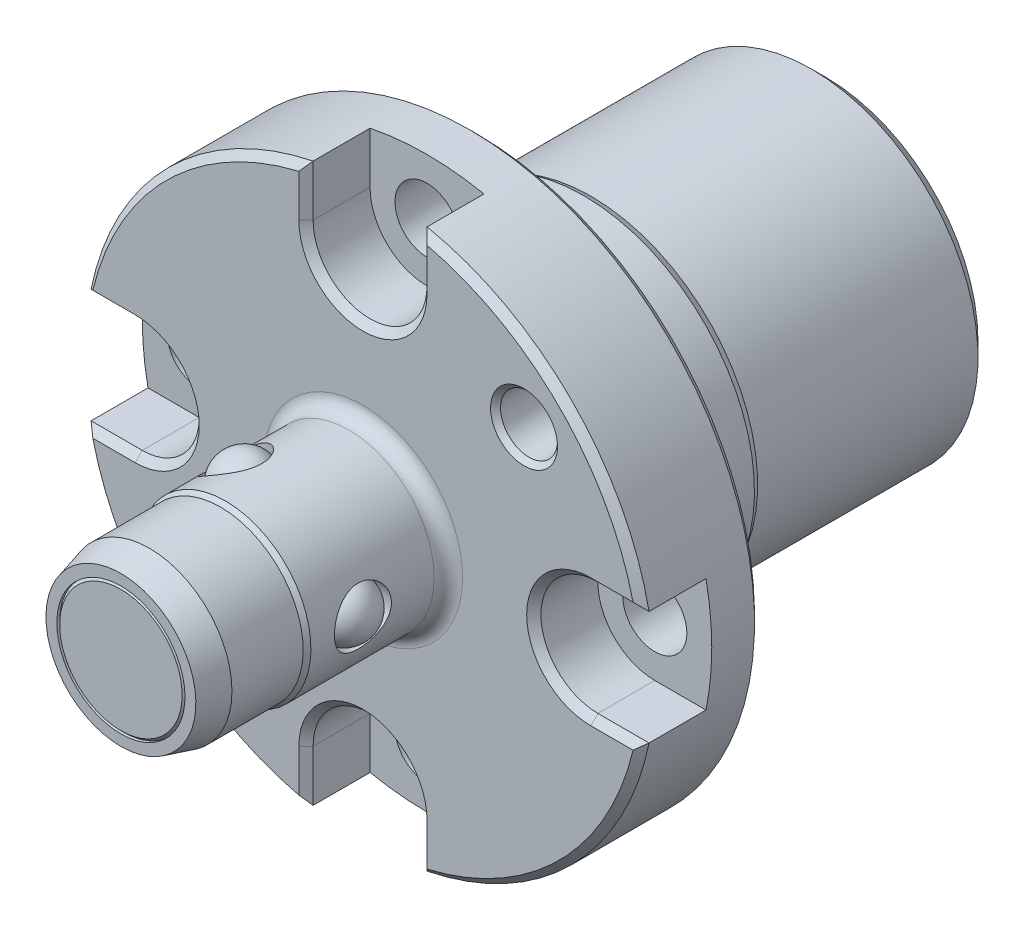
ISO-10303-21;
HEADER;
FILE_DESCRIPTION(('STEP AP214'),'2;1');
FILE_NAME('part.step','',(''),(''),'','','');
FILE_SCHEMA(('AUTOMOTIVE_DESIGN { 1 0 10303 214 1 1 1 1 }'));
ENDSEC;
DATA;
#1=APPLICATION_CONTEXT('core data for automotive mechanical design processes');
#2=APPLICATION_PROTOCOL_DEFINITION('international standard','automotive_design',2000,#1);
#3=PRODUCT_CONTEXT('',#1,'mechanical');
#4=PRODUCT('Part','Part','',(#3));
#5=PRODUCT_RELATED_PRODUCT_CATEGORY('part','',(#4));
#6=PRODUCT_DEFINITION_FORMATION('','',#4);
#7=PRODUCT_DEFINITION_CONTEXT('part definition',#1,'design');
#8=PRODUCT_DEFINITION('design','',#6,#7);
#9=PRODUCT_DEFINITION_SHAPE('','',#8);
#10=(LENGTH_UNIT() NAMED_UNIT(*) SI_UNIT(.MILLI.,.METRE.));
#11=(NAMED_UNIT(*) PLANE_ANGLE_UNIT() SI_UNIT($,.RADIAN.));
#12=(NAMED_UNIT(*) SI_UNIT($,.STERADIAN.) SOLID_ANGLE_UNIT());
#13=UNCERTAINTY_MEASURE_WITH_UNIT(LENGTH_MEASURE(1.E-05),#10,'distance_accuracy_value','');
#14=(GEOMETRIC_REPRESENTATION_CONTEXT(3) GLOBAL_UNCERTAINTY_ASSIGNED_CONTEXT((#13)) GLOBAL_UNIT_ASSIGNED_CONTEXT((#10,
#11,#12)) REPRESENTATION_CONTEXT('',''));
#15=CARTESIAN_POINT('',(0.,0.,0.));
#16=DIRECTION('',(0.,0.,1.));
#17=DIRECTION('',(1.,0.,0.));
#18=AXIS2_PLACEMENT_3D('',#15,#16,#17);
#19=CARTESIAN_POINT('',(-11.,0.,-2.5));
#20=DIRECTION('',(0.,0.,-1.));
#21=DIRECTION('',(0.,1.,0.));
#22=AXIS2_PLACEMENT_3D('',#19,#20,#21);
#23=PLANE('',#22);
#24=CARTESIAN_POINT('',(0.,0.,-2.5));
#25=DIRECTION('',(0.,0.,-1.));
#26=DIRECTION('',(0.,1.,0.));
#27=AXIS2_PLACEMENT_3D('',#24,#25,#26);
#28=CIRCLE('',#27,11.7);
#29=CARTESIAN_POINT('',(0.,11.7,-2.5));
#30=VERTEX_POINT('',#29);
#31=EDGE_CURVE('E1726',#30,#30,#28,.T.);
#32=ORIENTED_EDGE('',*,*,#31,.T.);
#33=EDGE_LOOP('',(#32));
#34=FACE_BOUND('',#33,.T.);
#35=CARTESIAN_POINT('',(0.,0.,-2.5));
#36=DIRECTION('',(0.,0.,1.));
#37=DIRECTION('',(1.,0.,0.));
#38=AXIS2_PLACEMENT_3D('',#35,#36,#37);
#39=CIRCLE('',#38,11.5);
#40=CARTESIAN_POINT('',(11.5,0.,-2.5));
#41=VERTEX_POINT('',#40);
#42=EDGE_CURVE('E138',#41,#41,#39,.T.);
#43=ORIENTED_EDGE('',*,*,#42,.T.);
#44=EDGE_LOOP('',(#43));
#45=FACE_BOUND('',#44,.T.);
#46=ADVANCED_FACE('F14',(#34,#45),#23,.T.);
#47=CARTESIAN_POINT('',(0.,0.,23.5));
#48=DIRECTION('',(0.,0.,1.));
#49=DIRECTION('',(0.,-1.,0.));
#50=AXIS2_PLACEMENT_3D('',#47,#48,#49);
#51=CYLINDRICAL_SURFACE('',#50,4.5);
#52=CARTESIAN_POINT('',(0.,0.,24.8));
#53=DIRECTION('',(0.,0.,1.));
#54=DIRECTION('',(1.,0.,0.));
#55=AXIS2_PLACEMENT_3D('',#52,#53,#54);
#56=CIRCLE('',#55,4.5);
#57=CARTESIAN_POINT('',(4.5,0.,24.8));
#58=VERTEX_POINT('',#57);
#59=EDGE_CURVE('E1636',#58,#58,#56,.F.);
#60=ORIENTED_EDGE('',*,*,#59,.T.);
#61=EDGE_LOOP('',(#60));
#62=FACE_BOUND('',#61,.T.);
#63=CARTESIAN_POINT('',(0.,0.,25.));
#64=DIRECTION('',(0.,0.,1.));
#65=DIRECTION('',(0.,-1.,0.));
#66=AXIS2_PLACEMENT_3D('',#63,#64,#65);
#67=CIRCLE('',#66,4.5);
#68=CARTESIAN_POINT('',(0.,-4.5,25.));
#69=VERTEX_POINT('',#68);
#70=EDGE_CURVE('E742',#69,#69,#67,.T.);
#71=ORIENTED_EDGE('',*,*,#70,.T.);
#72=EDGE_LOOP('',(#71));
#73=FACE_BOUND('',#72,.T.);
#74=ADVANCED_FACE('F701',(#62,#73),#51,.F.);
#75=CARTESIAN_POINT('',(6.,0.,25.));
#76=DIRECTION('',(0.,0.,1.));
#77=DIRECTION('',(0.,-1.,0.));
#78=AXIS2_PLACEMENT_3D('',#75,#76,#77);
#79=PLANE('',#78);
#80=CARTESIAN_POINT('',(0.,0.,25.));
#81=DIRECTION('',(0.,0.,1.));
#82=DIRECTION('',(0.,-1.,0.));
#83=AXIS2_PLACEMENT_3D('',#80,#81,#82);
#84=CIRCLE('',#83,5.26410161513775);
#85=CARTESIAN_POINT('',(0.,-5.26410161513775,25.));
#86=VERTEX_POINT('',#85);
#87=EDGE_CURVE('E1711',#86,#86,#84,.T.);
#88=ORIENTED_EDGE('',*,*,#87,.T.);
#89=EDGE_LOOP('',(#88));
#90=FACE_BOUND('',#89,.T.);
#91=ORIENTED_EDGE('',*,*,#70,.F.);
#92=EDGE_LOOP('',(#91));
#93=FACE_BOUND('',#92,.T.);
#94=ADVANCED_FACE('F597',(#90,#93),#79,.T.);
#95=CARTESIAN_POINT('',(0.,0.,23.));
#96=DIRECTION('',(0.,0.,-1.));
#97=DIRECTION('',(0.,1.,0.));
#98=AXIS2_PLACEMENT_3D('',#95,#96,#97);
#99=CONICAL_SURFACE('',#98,5.8,0.261799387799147);
#100=ORIENTED_EDGE('',*,*,#87,.F.);
#101=EDGE_LOOP('',(#100));
#102=FACE_BOUND('',#101,.T.);
#103=CARTESIAN_POINT('',(0.,0.,23.));
#104=DIRECTION('',(0.,0.,1.));
#105=DIRECTION('',(0.,-1.,0.));
#106=AXIS2_PLACEMENT_3D('',#103,#104,#105);
#107=CIRCLE('',#106,5.8);
#108=CARTESIAN_POINT('',(0.,-5.8,23.));
#109=VERTEX_POINT('',#108);
#110=EDGE_CURVE('E1707',#109,#109,#107,.F.);
#111=ORIENTED_EDGE('',*,*,#110,.F.);
#112=EDGE_LOOP('',(#111));
#113=FACE_BOUND('',#112,.T.);
#114=ADVANCED_FACE('F627',(#102,#113),#99,.T.);
#115=CARTESIAN_POINT('',(0.,0.,-24.5));
#116=DIRECTION('',(0.,0.,-1.));
#117=DIRECTION('',(0.,1.,0.));
#118=AXIS2_PLACEMENT_3D('',#115,#116,#117);
#119=CYLINDRICAL_SURFACE('',#118,5.8);
#120=ORIENTED_EDGE('',*,*,#110,.T.);
#121=EDGE_LOOP('',(#120));
#122=FACE_BOUND('',#121,.T.);
#123=CARTESIAN_POINT('',(0.,0.,18.));
#124=DIRECTION('',(0.,0.,-1.));
#125=DIRECTION('',(0.,1.,0.));
#126=AXIS2_PLACEMENT_3D('',#123,#124,#125);
#127=CIRCLE('',#126,5.8);
#128=CARTESIAN_POINT('',(0.,5.8,18.));
#129=VERTEX_POINT('',#128);
#130=EDGE_CURVE('E1676',#129,#129,#127,.T.);
#131=ORIENTED_EDGE('',*,*,#130,.F.);
#132=EDGE_LOOP('',(#131));
#133=FACE_BOUND('',#132,.T.);
#134=ADVANCED_FACE('F605',(#122,#133),#119,.T.);
#135=CARTESIAN_POINT('',(0.,0.,17.6535898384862));
#136=DIRECTION('',(0.,0.,-1.));
#137=DIRECTION('',(0.,1.,0.));
#138=AXIS2_PLACEMENT_3D('',#135,#136,#137);
#139=CONICAL_SURFACE('',#138,6.,0.523598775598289);
#140=ORIENTED_EDGE('',*,*,#130,.T.);
#141=EDGE_LOOP('',(#140));
#142=FACE_BOUND('',#141,.T.);
#143=CARTESIAN_POINT('',(0.,0.,17.6535898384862));
#144=DIRECTION('',(0.,0.,-1.));
#145=DIRECTION('',(0.,1.,0.));
#146=AXIS2_PLACEMENT_3D('',#143,#144,#145);
#147=CIRCLE('',#146,6.);
#148=CARTESIAN_POINT('',(0.,6.,17.6535898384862));
#149=VERTEX_POINT('',#148);
#150=EDGE_CURVE('E1706',#149,#149,#147,.T.);
#151=ORIENTED_EDGE('',*,*,#150,.F.);
#152=EDGE_LOOP('',(#151));
#153=FACE_BOUND('',#152,.T.);
#154=ADVANCED_FACE('F604',(#142,#153),#139,.T.);
#155=CARTESIAN_POINT('',(0.,0.,-24.5));
#156=DIRECTION('',(0.,0.,-1.));
#157=DIRECTION('',(0.,1.,0.));
#158=AXIS2_PLACEMENT_3D('',#155,#156,#157);
#159=CYLINDRICAL_SURFACE('',#158,6.);
#160=ORIENTED_EDGE('',*,*,#150,.T.);
#161=EDGE_LOOP('',(#160));
#162=FACE_BOUND('',#161,.T.);
#163=CARTESIAN_POINT('',(0.,0.,9.));
#164=DIRECTION('',(0.,0.,1.));
#165=DIRECTION('',(0.,-1.,0.));
#166=AXIS2_PLACEMENT_3D('',#163,#164,#165);
#167=CIRCLE('',#166,6.);
#168=CARTESIAN_POINT('',(0.,-6.,9.));
#169=VERTEX_POINT('',#168);
#170=EDGE_CURVE('E587',#169,#169,#167,.T.);
#171=ORIENTED_EDGE('',*,*,#170,.T.);
#172=EDGE_LOOP('',(#171));
#173=FACE_BOUND('',#172,.T.);
#174=CARTESIAN_POINT('',(-4.56047793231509,-3.89897948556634,14.));
#175=CARTESIAN_POINT('',(-4.56047819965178,-3.89897891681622,14.1089363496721));
#176=CARTESIAN_POINT('',(-4.554334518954,-3.90619964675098,14.2178695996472));
#177=CARTESIAN_POINT('',(-4.52986358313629,-3.93454935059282,14.4325088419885));
#178=CARTESIAN_POINT('',(-4.51153432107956,-3.95568061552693,14.5382142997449));
#179=CARTESIAN_POINT('',(-4.46301218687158,-4.01034191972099,14.7432537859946));
#180=CARTESIAN_POINT('',(-4.43284256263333,-4.04384765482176,14.8425998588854));
#181=CARTESIAN_POINT('',(-4.36099755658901,-4.12122282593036,15.0327200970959));
#182=CARTESIAN_POINT('',(-4.31931963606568,-4.16509454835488,15.1234923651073));
#183=CARTESIAN_POINT('',(-4.2231882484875,-4.2625720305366,15.2974399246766));
#184=CARTESIAN_POINT('',(-4.16833358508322,-4.31646818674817,15.3802308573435));
#185=CARTESIAN_POINT('',(-4.04729005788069,-4.43016134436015,15.5324136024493));
#186=CARTESIAN_POINT('',(-3.98109937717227,-4.48995929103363,15.6018032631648));
#187=CARTESIAN_POINT('',(-3.83633546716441,-4.61430991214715,15.7269577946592));
#188=CARTESIAN_POINT('',(-3.7574842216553,-4.67894593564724,15.7823199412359));
#189=CARTESIAN_POINT('',(-3.59012465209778,-4.80855341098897,15.875183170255));
#190=CARTESIAN_POINT('',(-3.5016189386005,-4.87352476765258,15.9126890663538));
#191=CARTESIAN_POINT('',(-3.32026621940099,-4.99875451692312,15.9674717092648));
#192=CARTESIAN_POINT('',(-3.22767740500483,-5.05909823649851,15.985406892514));
#193=CARTESIAN_POINT('',(-3.03801790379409,-5.17520986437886,16.0026325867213));
#194=CARTESIAN_POINT('',(-2.94094837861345,-5.23097894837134,16.0019279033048));
#195=CARTESIAN_POINT('',(-2.74919783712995,-5.33416439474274,15.9823114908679));
#196=CARTESIAN_POINT('',(-2.65457246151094,-5.3818225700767,15.964114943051));
#197=CARTESIAN_POINT('',(-2.4668184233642,-5.47042859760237,15.9112140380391));
#198=CARTESIAN_POINT('',(-2.37368986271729,-5.51137599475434,15.8765085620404));
#199=CARTESIAN_POINT('',(-2.19053384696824,-5.58672581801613,15.7911573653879));
#200=CARTESIAN_POINT('',(-2.10056324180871,-5.62103514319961,15.740308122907));
#201=CARTESIAN_POINT('',(-1.92773322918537,-5.68262919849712,15.6242805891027));
#202=CARTESIAN_POINT('',(-1.84487580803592,-5.70991197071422,15.5590983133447));
#203=CARTESIAN_POINT('',(-1.68513113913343,-5.75913621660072,15.4126512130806));
#204=CARTESIAN_POINT('',(-1.60870864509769,-5.78076573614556,15.330773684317));
#205=CARTESIAN_POINT('',(-1.46917556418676,-5.8177957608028,15.1551025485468));
#206=CARTESIAN_POINT('',(-1.40606702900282,-5.83319530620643,15.0613071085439));
#207=CARTESIAN_POINT('',(-1.29495304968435,-5.8588742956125,14.8626927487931));
#208=CARTESIAN_POINT('',(-1.24717574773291,-5.86907761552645,14.7577357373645));
#209=CARTESIAN_POINT('',(-1.17035189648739,-5.88488172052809,14.5408572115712));
#210=CARTESIAN_POINT('',(-1.14129749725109,-5.89048443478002,14.4289386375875));
#211=CARTESIAN_POINT('',(-1.10439441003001,-5.89751235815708,14.2067232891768));
#212=CARTESIAN_POINT('',(-1.09564814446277,-5.89911463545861,14.0965811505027));
#213=CARTESIAN_POINT('',(-1.09719931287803,-5.89882671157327,13.8764477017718));
#214=CARTESIAN_POINT('',(-1.10749328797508,-5.89693714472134,13.766456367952));
#215=CARTESIAN_POINT('',(-1.14586375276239,-5.88959684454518,13.5536860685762));
#216=CARTESIAN_POINT('',(-1.17331725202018,-5.88427066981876,13.4507891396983));
#217=CARTESIAN_POINT('',(-1.24410594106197,-5.86971015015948,13.2509127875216));
#218=CARTESIAN_POINT('',(-1.28744394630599,-5.86047511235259,13.1539344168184));
#219=CARTESIAN_POINT('',(-1.38977965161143,-5.83706633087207,12.965239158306));
#220=CARTESIAN_POINT('',(-1.4492304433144,-5.82274523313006,12.8737867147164));
#221=CARTESIAN_POINT('',(-1.58082063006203,-5.78840417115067,12.7017078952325));
#222=CARTESIAN_POINT('',(-1.65296376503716,-5.76838252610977,12.6210847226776));
#223=CARTESIAN_POINT('',(-1.81123313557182,-5.72071463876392,12.4689440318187));
#224=CARTESIAN_POINT('',(-1.89786512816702,-5.69274791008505,12.3980512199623));
#225=CARTESIAN_POINT('',(-2.07941789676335,-5.62896661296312,12.2721677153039));
#226=CARTESIAN_POINT('',(-2.17433837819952,-5.59315232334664,12.2171764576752));
#227=CARTESIAN_POINT('',(-2.36861141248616,-5.51367475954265,12.1251597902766));
#228=CARTESIAN_POINT('',(-2.46793032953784,-5.47006521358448,12.0880174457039));
#229=CARTESIAN_POINT('',(-2.66816647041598,-5.37523375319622,12.0325445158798));
#230=CARTESIAN_POINT('',(-2.76908310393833,-5.32401459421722,12.014207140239));
#231=CARTESIAN_POINT('',(-2.96436541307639,-5.21769285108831,11.9974758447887));
#232=CARTESIAN_POINT('',(-3.05881605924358,-5.16288592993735,11.9981850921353));
#233=CARTESIAN_POINT('',(-3.2432656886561,-5.04905637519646,12.0173146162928));
#234=CARTESIAN_POINT('',(-3.33326503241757,-4.99003408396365,12.0357334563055));
#235=CARTESIAN_POINT('',(-3.50509734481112,-4.87083820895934,12.0891644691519));
#236=CARTESIAN_POINT('',(-3.58703731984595,-4.81069780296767,12.1239084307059));
#237=CARTESIAN_POINT('',(-3.74269287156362,-4.69062080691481,12.2087550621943));
#238=CARTESIAN_POINT('',(-3.81640695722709,-4.63068425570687,12.258860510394));
#239=CARTESIAN_POINT('',(-3.95700655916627,-4.51120034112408,12.375139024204));
#240=CARTESIAN_POINT('',(-4.02353912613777,-4.45174918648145,12.4418373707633));
#241=CARTESIAN_POINT('',(-4.14569232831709,-4.33822564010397,12.5885147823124));
#242=CARTESIAN_POINT('',(-4.20130946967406,-4.2841549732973,12.6684980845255));
#243=CARTESIAN_POINT('',(-4.30300315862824,-4.18205286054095,12.8432187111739));
#244=CARTESIAN_POINT('',(-4.34862101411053,-4.13434067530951,12.9384110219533));
#245=CARTESIAN_POINT('',(-4.42692032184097,-4.05039354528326,13.1386688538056));
#246=CARTESIAN_POINT('',(-4.45960515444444,-4.01415560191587,13.2437317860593));
#247=CARTESIAN_POINT('',(-4.51043982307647,-3.95693562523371,13.4559236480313));
#248=CARTESIAN_POINT('',(-4.52917988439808,-3.93533803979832,13.5627445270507));
#249=CARTESIAN_POINT('',(-4.5541966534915,-3.90636271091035,13.7797121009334));
#250=CARTESIAN_POINT('',(-4.56047766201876,-3.89898006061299,13.8898576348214));
#251=CARTESIAN_POINT('',(-4.56047793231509,-3.89897948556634,14.));
#252=B_SPLINE_CURVE_WITH_KNOTS('',3,(#174,#175,#176,#177,#178,#179,#180,#181,#182,#183,#184,
#185,#186,#187,#188,#189,#190,#191,#192,#193,#194,#195,#196,#197,#198,#199,#200,#201,#202,#203,
#204,#205,#206,#207,#208,#209,#210,#211,#212,#213,#214,#215,#216,#217,#218,#219,#220,#221,#222,
#223,#224,#225,#226,#227,#228,#229,#230,#231,#232,#233,#234,#235,#236,#237,#238,#239,#240,#241,
#242,#243,#244,#245,#246,#247,#248,#249,#250,#251),.UNSPECIFIED.,.T.,.F.,(4,2,2,2,2,2,2,2,2,2,2,
2,2,2,2,2,2,2,2,2,2,2,2,2,2,2,2,2,2,2,2,2,2,2,2,2,2,2,4),(0.,0.326401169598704,
0.652856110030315,0.978673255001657,1.3045623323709,1.64202674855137,1.97954530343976,
2.32587012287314,2.67210152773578,3.00628637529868,3.34038506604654,3.66138009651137,
3.98239688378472,4.30763309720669,4.63295983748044,4.97360348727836,5.31429959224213,
5.65985279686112,6.00526102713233,6.3350858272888,6.66485071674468,6.98328791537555,
7.30178158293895,7.63037715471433,7.95906971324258,8.30357616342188,8.64807037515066,
8.99027582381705,9.33235766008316,9.65836169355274,9.98433928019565,10.3051391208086,
10.6259970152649,10.9587103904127,11.2915300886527,11.6373780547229,11.9831355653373,
12.3132642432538,12.6432789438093),.UNSPECIFIED.);
#253=CARTESIAN_POINT('',(-4.56047793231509,-3.89897948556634,14.));
#254=VERTEX_POINT('',#253);
#255=EDGE_CURVE('E741',#254,#254,#252,.T.);
#256=ORIENTED_EDGE('',*,*,#255,.T.);
#257=EDGE_LOOP('',(#256));
#258=FACE_BOUND('',#257,.T.);
#259=CARTESIAN_POINT('',(5.65685424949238,-2.,14.));
#260=CARTESIAN_POINT('',(5.65685389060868,-2.00000051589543,14.1089363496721));
#261=CARTESIAN_POINT('',(5.66003538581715,-1.99106956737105,14.2178695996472));
#262=CARTESIAN_POINT('',(5.6723514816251,-1.95570226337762,14.4325088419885));
#263=CARTESIAN_POINT('',(5.68148706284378,-1.92926302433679,14.5382142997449));
#264=CARTESIAN_POINT('',(5.70456407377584,-1.85991097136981,14.7432537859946));
#265=CARTESIAN_POINT('',(5.71849607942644,-1.81703044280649,14.8425998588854));
#266=CARTESIAN_POINT('',(5.74958244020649,-1.71612325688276,15.0327200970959));
#267=CARTESIAN_POINT('',(5.76673750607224,-1.65809325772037,15.1234923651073));
#268=CARTESIAN_POINT('',(5.80308978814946,-1.52610229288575,15.2974399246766));
#269=CARTESIAN_POINT('',(5.82233789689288,-1.45164868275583,15.3802308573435));
#270=CARTESIAN_POINT('',(5.86027729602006,-1.28997533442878,15.5324136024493));
#271=CARTESIAN_POINT('',(5.87896849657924,-1.20275355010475,15.6018032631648));
#272=CARTESIAN_POINT('',(5.91427733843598,-1.01520901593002,15.7269577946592));
#273=CARTESIAN_POINT('',(5.93082815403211,-0.914603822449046,15.7823199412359));
#274=CARTESIAN_POINT('',(5.95939173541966,-0.704862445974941,15.875183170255));
#275=CARTESIAN_POINT('',(5.97140572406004,-0.59572857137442,15.9126890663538));
#276=CARTESIAN_POINT('',(5.98918150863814,-0.376057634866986,15.9674717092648));
#277=CARTESIAN_POINT('',(5.99514629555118,-0.265701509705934,15.985406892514));
#278=CARTESIAN_POINT('',(6.00087216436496,-0.0433957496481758,16.0026325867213));
#279=CARTESIAN_POINT('',(6.00063484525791,0.0685534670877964,16.0019279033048));
#280=CARTESIAN_POINT('',(5.99412079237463,0.286207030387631,15.9823114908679));
#281=CARTESIAN_POINT('',(5.98808129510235,0.391984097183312,15.964114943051));
#282=CARTESIAN_POINT('',(5.97093934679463,0.598886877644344,15.9112140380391));
#283=CARTESIAN_POINT('',(5.95983655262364,0.700012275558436,15.8765085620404));
#284=CARTESIAN_POINT('',(5.93351340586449,0.896304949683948,15.7911573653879));
#285=CARTESIAN_POINT('',(5.91824085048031,0.991376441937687,15.740308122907));
#286=CARTESIAN_POINT('',(5.88516786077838,1.17184865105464,15.6242805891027));
#287=CARTESIAN_POINT('',(5.86736672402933,1.25724666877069,15.5590983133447));
#288=CARTESIAN_POINT('',(5.83012383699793,1.42020173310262,15.4126512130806));
#289=CARTESIAN_POINT('',(5.81064430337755,1.49720031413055,15.330773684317));
#290=CARTESIAN_POINT('',(5.77294670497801,1.63655451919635,15.1551025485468));
#291=CARTESIAN_POINT('',(5.75472883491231,1.69890788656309,15.0613071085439));
#292=CARTESIAN_POINT('',(5.72141050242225,1.80797491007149,14.8626927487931));
#293=CARTESIAN_POINT('',(5.70635818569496,1.85445292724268,14.7577357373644));
#294=CARTESIAN_POINT('',(5.68163301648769,1.92888638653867,14.5408572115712));
#295=CARTESIAN_POINT('',(5.67195790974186,1.95684959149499,14.4289386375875));
#296=CARTESIAN_POINT('',(5.6595927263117,1.99232256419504,14.2067232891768));
#297=CARTESIAN_POINT('',(5.65660720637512,2.00069819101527,14.0965811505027));
#298=CARTESIAN_POINT('',(5.65713344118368,1.99921087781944,13.8764477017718));
#299=CARTESIAN_POINT('',(5.66064401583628,1.98935125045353,13.766456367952));
#300=CARTESIAN_POINT('',(5.67347236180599,1.95245130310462,13.5536860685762));
#301=CARTESIAN_POINT('',(5.68258650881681,1.92601278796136,13.4507891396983));
#302=CARTESIAN_POINT('',(5.70537107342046,1.85742772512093,13.2509127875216));
#303=CARTESIAN_POINT('',(5.71904229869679,1.81527839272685,13.1539344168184));
#304=CARTESIAN_POINT('',(5.74993755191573,1.71494868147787,12.965239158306));
#305=CARTESIAN_POINT('',(5.76726051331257,1.65630223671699,12.8737867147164));
#306=CARTESIAN_POINT('',(5.80331537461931,1.52517126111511,12.7017078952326));
#307=CARTESIAN_POINT('',(5.82204768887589,1.45268265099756,12.6210847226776));
#308=CARTESIAN_POINT('',(5.85990077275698,1.29178341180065,12.4689440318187));
#309=CARTESIAN_POINT('',(5.87899687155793,1.2027745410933,12.3980512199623));
#310=CARTESIAN_POINT('',(5.91453703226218,1.01365458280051,12.2721677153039));
#311=CARTESIAN_POINT('',(5.93098118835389,0.9135438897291,12.2171764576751));
#312=CARTESIAN_POINT('',(5.95928811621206,0.705559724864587,12.1251597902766));
#313=CARTESIAN_POINT('',(5.97118060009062,0.597742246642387,12.0880174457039));
#314=CARTESIAN_POINT('',(5.98917221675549,0.376916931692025,12.0325445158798));
#315=CARTESIAN_POINT('',(5.99527344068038,0.263910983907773,12.014207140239));
#316=CARTESIAN_POINT('',(6.00083726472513,0.0416306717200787,11.9974758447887));
#317=CARTESIAN_POINT('',(6.00059840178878,-0.0675694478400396,11.9981850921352));
#318=CARTESIAN_POINT('',(5.99424393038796,-0.284222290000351,12.0173146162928));
#319=CARTESIAN_POINT('',(5.98812879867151,-0.391675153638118,12.0357334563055));
#320=CARTESIAN_POINT('',(5.97081829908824,-0.60008423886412,12.0891644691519));
#321=CARTESIAN_POINT('',(5.95970516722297,-0.701116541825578,12.1239084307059));
#322=CARTESIAN_POINT('',(5.9335432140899,-0.895956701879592,12.2087550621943));
#323=CARTESIAN_POINT('',(5.91849368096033,-0.989763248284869,12.258860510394));
#324=CARTESIAN_POINT('',(5.88531737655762,-1.17126803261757,12.375139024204));
#325=CARTESIAN_POINT('',(5.86709744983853,-1.25861250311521,12.4418373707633));
#326=CARTESIAN_POINT('',(5.82985977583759,-1.42116205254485,12.5885147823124));
#327=CARTESIAN_POINT('',(5.81084177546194,-1.49636324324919,12.6684980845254));
#328=CARTESIAN_POINT('',(5.77326559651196,-1.63548361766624,12.8432187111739));
#329=CARTESIAN_POINT('',(5.75475455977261,-1.6988459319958,12.9384110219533));
#330=CARTESIAN_POINT('',(5.72120386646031,-1.80862868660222,13.1386688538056));
#331=CARTESIAN_POINT('',(5.70616330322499,-1.85505355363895,13.2437317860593));
#332=CARTESIAN_POINT('',(5.68202668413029,-1.92768765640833,13.4559236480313));
#333=CARTESIAN_POINT('',(5.67269265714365,-1.95471581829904,13.5627445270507));
#334=CARTESIAN_POINT('',(5.66010767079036,-1.99086864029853,13.7797121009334));
#335=CARTESIAN_POINT('',(5.65685461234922,-1.99999947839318,13.8898576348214));
#336=CARTESIAN_POINT('',(5.65685424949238,-2.,14.));
#337=B_SPLINE_CURVE_WITH_KNOTS('',3,(#259,#260,#261,#262,#263,#264,#265,#266,#267,#268,#269,
#270,#271,#272,#273,#274,#275,#276,#277,#278,#279,#280,#281,#282,#283,#284,#285,#286,#287,#288,
#289,#290,#291,#292,#293,#294,#295,#296,#297,#298,#299,#300,#301,#302,#303,#304,#305,#306,#307,
#308,#309,#310,#311,#312,#313,#314,#315,#316,#317,#318,#319,#320,#321,#322,#323,#324,#325,#326,
#327,#328,#329,#330,#331,#332,#333,#334,#335,#336),.UNSPECIFIED.,.T.,.F.,(4,2,2,2,2,2,2,2,2,2,2,
2,2,2,2,2,2,2,2,2,2,2,2,2,2,2,2,2,2,2,2,2,2,2,2,2,2,2,4),(0.,0.326401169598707,
0.652856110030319,0.978673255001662,1.3045623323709,1.64202674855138,1.97954530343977,
2.32587012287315,2.67210152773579,3.00628637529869,3.34038506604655,3.66138009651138,
3.98239688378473,4.3076330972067,4.63295983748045,4.97360348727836,5.31429959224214,
5.65985279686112,6.00526102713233,6.3350858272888,6.66485071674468,6.98328791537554,
7.30178158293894,7.63037715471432,7.95906971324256,8.30357616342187,8.64807037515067,
8.99027582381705,9.33235766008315,9.65836169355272,9.98433928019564,10.3051391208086,
10.6259970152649,10.9587103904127,11.2915300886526,11.6373780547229,11.9831355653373,
12.3132642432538,12.6432789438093),.UNSPECIFIED.);
#338=CARTESIAN_POINT('',(5.65685424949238,-2.,14.));
#339=VERTEX_POINT('',#338);
#340=EDGE_CURVE('E758',#339,#339,#337,.T.);
#341=ORIENTED_EDGE('',*,*,#340,.T.);
#342=EDGE_LOOP('',(#341));
#343=FACE_BOUND('',#342,.T.);
#344=CARTESIAN_POINT('',(-1.09637631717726,5.89897948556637,14.));
#345=CARTESIAN_POINT('',(-1.09637569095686,5.89897943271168,14.1089363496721));
#346=CARTESIAN_POINT('',(-1.1057008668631,5.89726921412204,14.2178695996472));
#347=CARTESIAN_POINT('',(-1.14248789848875,5.89025161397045,14.4325088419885));
#348=CARTESIAN_POINT('',(-1.16995274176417,5.88494363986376,14.5382142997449));
#349=CARTESIAN_POINT('',(-1.24155188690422,5.87025289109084,14.7432537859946));
#350=CARTESIAN_POINT('',(-1.28565351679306,5.86087809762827,14.8425998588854));
#351=CARTESIAN_POINT('',(-1.38858488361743,5.83734608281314,15.0327200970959));
#352=CARTESIAN_POINT('',(-1.44741787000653,5.82318780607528,15.1234923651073));
#353=CARTESIAN_POINT('',(-1.57990153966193,5.78867432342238,15.2974399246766));
#354=CARTESIAN_POINT('',(-1.65400431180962,5.76811686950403,15.3802308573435));
#355=CARTESIAN_POINT('',(-1.81298723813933,5.72013667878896,15.5324136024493));
#356=CARTESIAN_POINT('',(-1.89786911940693,5.69271284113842,15.6018032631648));
#357=CARTESIAN_POINT('',(-2.07794187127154,5.62951892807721,15.7269577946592));
#358=CARTESIAN_POINT('',(-2.17334393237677,5.59354975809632,15.7823199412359));
#359=CARTESIAN_POINT('',(-2.36926708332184,5.51341585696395,15.875183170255));
#360=CARTESIAN_POINT('',(-2.46978678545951,5.46925333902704,15.9126890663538));
#361=CARTESIAN_POINT('',(-2.66891528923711,5.37481215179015,15.9674717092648));
#362=CARTESIAN_POINT('',(-2.76746889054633,5.32479974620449,15.985406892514));
#363=CARTESIAN_POINT('',(-2.96285426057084,5.21860561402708,16.0026325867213));
#364=CARTESIAN_POINT('',(-3.05968646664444,5.16242548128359,16.0019279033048));
#365=CARTESIAN_POINT('',(-3.24492295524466,5.04795736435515,15.9823114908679));
#366=CARTESIAN_POINT('',(-3.33350883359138,4.98983847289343,15.964114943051));
#367=CARTESIAN_POINT('',(-3.50412092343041,4.87154171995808,15.9112140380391));
#368=CARTESIAN_POINT('',(-3.58614668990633,4.81136371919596,15.8765085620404));
#369=CARTESIAN_POINT('',(-3.74297955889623,4.69042086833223,15.7911573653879));
#370=CARTESIAN_POINT('',(-3.81767760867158,4.62965870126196,15.740308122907));
#371=CARTESIAN_POINT('',(-3.957434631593,4.51078054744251,15.6242805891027));
#372=CARTESIAN_POINT('',(-4.0224909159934,4.45266530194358,15.5590983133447));
#373=CARTESIAN_POINT('',(-4.14499269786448,4.33893448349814,15.4126512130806));
#374=CARTESIAN_POINT('',(-4.20193565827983,4.28356542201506,15.330773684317));
#375=CARTESIAN_POINT('',(-4.30377114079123,4.18124124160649,15.1551025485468));
#376=CARTESIAN_POINT('',(-4.34866180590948,4.13428741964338,15.0613071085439));
#377=CARTESIAN_POINT('',(-4.42645745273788,4.05089938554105,14.8626927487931));
#378=CARTESIAN_POINT('',(-4.45918243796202,4.01462468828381,14.7577357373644));
#379=CARTESIAN_POINT('',(-4.51128112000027,3.95599533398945,14.5408572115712));
#380=CARTESIAN_POINT('',(-4.53066041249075,3.93363484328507,14.4289386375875));
#381=CARTESIAN_POINT('',(-4.55519831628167,3.90518979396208,14.2067232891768));
#382=CARTESIAN_POINT('',(-4.56095906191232,3.89841644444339,14.0965811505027));
#383=CARTESIAN_POINT('',(-4.55993412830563,3.89961583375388,13.8764477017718));
#384=CARTESIAN_POINT('',(-4.5531507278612,3.90758589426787,13.766456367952));
#385=CARTESIAN_POINT('',(-4.52760860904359,3.93714554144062,13.5536860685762));
#386=CARTESIAN_POINT('',(-4.5092692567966,3.95825788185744,13.4507891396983));
#387=CARTESIAN_POINT('',(-4.46126513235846,4.01228242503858,13.2509127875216));
#388=CARTESIAN_POINT('',(-4.43159835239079,4.04519671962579,13.1539344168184));
#389=CARTESIAN_POINT('',(-4.3601579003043,4.12211764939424,12.965239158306));
#390=CARTESIAN_POINT('',(-4.31803006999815,4.16644299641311,12.8737867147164));
#391=CARTESIAN_POINT('',(-4.22249474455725,4.26323291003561,12.7017078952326));
#392=CARTESIAN_POINT('',(-4.16908392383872,4.31569987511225,12.6210847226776));
#393=CARTESIAN_POINT('',(-4.04866763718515,4.42893122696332,12.4689440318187));
#394=CARTESIAN_POINT('',(-3.98113174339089,4.4899733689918,12.3980512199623));
#395=CARTESIAN_POINT('',(-3.8351191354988,4.61531203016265,12.2721677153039));
#396=CARTESIAN_POINT('',(-3.75664281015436,4.67960843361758,12.2171764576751));
#397=CARTESIAN_POINT('',(-3.59067670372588,4.80811503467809,12.1251597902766));
#398=CARTESIAN_POINT('',(-3.50325027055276,4.87232296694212,12.0880174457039));
#399=CARTESIAN_POINT('',(-3.32100574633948,4.99831682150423,12.0325445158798));
#400=CARTESIAN_POINT('',(-3.22619033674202,5.06010361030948,12.014207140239));
#401=CARTESIAN_POINT('',(-3.03647185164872,5.17606217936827,11.9974758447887));
#402=CARTESIAN_POINT('',(-2.94178234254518,5.23045537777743,11.9981850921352));
#403=CARTESIAN_POINT('',(-2.75097824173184,5.33327866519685,12.0173146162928));
#404=CARTESIAN_POINT('',(-2.65486376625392,5.38170923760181,12.0357334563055));
#405=CARTESIAN_POINT('',(-2.4657209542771,5.4709224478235,12.0891644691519));
#406=CARTESIAN_POINT('',(-2.37266784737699,5.51181434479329,12.1239084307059));
#407=CARTESIAN_POINT('',(-2.19085034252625,5.58657750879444,12.2087550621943));
#408=CARTESIAN_POINT('',(-2.10208672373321,5.62044750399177,12.258860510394));
#409=CARTESIAN_POINT('',(-1.92831081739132,5.68246837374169,12.375139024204));
#410=CARTESIAN_POINT('',(-1.84355832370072,5.71036168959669,12.4418373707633));
#411=CARTESIAN_POINT('',(-1.68416744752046,5.75938769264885,12.5885147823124));
#412=CARTESIAN_POINT('',(-1.60953230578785,5.78051821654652,12.6684980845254));
#413=CARTESIAN_POINT('',(-1.47026243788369,5.81753647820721,12.8432187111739));
#414=CARTESIAN_POINT('',(-1.40613354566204,5.83318660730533,12.9384110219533));
#415=CARTESIAN_POINT('',(-1.29428354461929,5.8590222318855,13.1386688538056));
#416=CARTESIAN_POINT('',(-1.24655814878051,5.86920915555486,13.2437317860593));
#417=CARTESIAN_POINT('',(-1.17158686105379,5.88462328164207,13.4559236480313));
#418=CARTESIAN_POINT('',(-1.14351277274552,5.89005385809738,13.5627445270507));
#419=CARTESIAN_POINT('',(-1.10591101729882,5.8972313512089,13.7797121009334));
#420=CARTESIAN_POINT('',(-1.09637695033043,5.89897953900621,13.8898576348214));
#421=CARTESIAN_POINT('',(-1.09637631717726,5.89897948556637,14.));
#422=B_SPLINE_CURVE_WITH_KNOTS('',3,(#344,#345,#346,#347,#348,#349,#350,#351,#352,#353,#354,
#355,#356,#357,#358,#359,#360,#361,#362,#363,#364,#365,#366,#367,#368,#369,#370,#371,#372,#373,
#374,#375,#376,#377,#378,#379,#380,#381,#382,#383,#384,#385,#386,#387,#388,#389,#390,#391,#392,
#393,#394,#395,#396,#397,#398,#399,#400,#401,#402,#403,#404,#405,#406,#407,#408,#409,#410,#411,
#412,#413,#414,#415,#416,#417,#418,#419,#420,#421),.UNSPECIFIED.,.T.,.F.,(4,2,2,2,2,2,2,2,2,2,2,
2,2,2,2,2,2,2,2,2,2,2,2,2,2,2,2,2,2,2,2,2,2,2,2,2,2,2,4),(0.,0.326401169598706,
0.652856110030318,0.978673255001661,1.3045623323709,1.64202674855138,1.97954530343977,
2.32587012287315,2.67210152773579,3.00628637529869,3.34038506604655,3.66138009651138,
3.98239688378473,4.3076330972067,4.63295983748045,4.97360348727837,5.31429959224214,
5.65985279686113,6.00526102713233,6.3350858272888,6.66485071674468,6.98328791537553,
7.30178158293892,7.63037715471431,7.95906971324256,8.30357616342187,8.64807037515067,
8.99027582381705,9.33235766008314,9.65836169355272,9.98433928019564,10.3051391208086,
10.6259970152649,10.9587103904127,11.2915300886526,11.6373780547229,11.9831355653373,
12.3132642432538,12.6432789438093),.UNSPECIFIED.);
#423=CARTESIAN_POINT('',(-1.09637631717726,5.89897948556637,14.));
#424=VERTEX_POINT('',#423);
#425=EDGE_CURVE('E733',#424,#424,#422,.T.);
#426=ORIENTED_EDGE('',*,*,#425,.T.);
#427=EDGE_LOOP('',(#426));
#428=FACE_BOUND('',#427,.T.);
#429=ADVANCED_FACE('F602',(#162,#173,#258,#343,#428),#159,.T.);
#430=CARTESIAN_POINT('',(0.,0.,9.));
#431=DIRECTION('',(0.,0.,1.));
#432=DIRECTION('',(0.,-1.,0.));
#433=AXIS2_PLACEMENT_3D('',#430,#431,#432);
#434=TOROIDAL_SURFACE('',#433,7.,1.);
#435=CARTESIAN_POINT('',(0.,0.,8.));
#436=DIRECTION('',(0.,0.,1.));
#437=DIRECTION('',(0.,-1.,0.));
#438=AXIS2_PLACEMENT_3D('',#435,#436,#437);
#439=CIRCLE('',#438,7.);
#440=CARTESIAN_POINT('',(0.,-7.,8.));
#441=VERTEX_POINT('',#440);
#442=EDGE_CURVE('E1807',#441,#441,#439,.F.);
#443=ORIENTED_EDGE('',*,*,#442,.F.);
#444=EDGE_LOOP('',(#443));
#445=FACE_BOUND('',#444,.T.);
#446=ORIENTED_EDGE('',*,*,#170,.F.);
#447=EDGE_LOOP('',(#446));
#448=FACE_BOUND('',#447,.T.);
#449=ADVANCED_FACE('F598',(#445,#448),#434,.F.);
#450=CARTESIAN_POINT('',(0.,0.,14.));
#451=DIRECTION('',(0.5,0.866025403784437,0.));
#452=DIRECTION('',(-0.866025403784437,0.5,0.));
#453=AXIS2_PLACEMENT_3D('',#450,#451,#452);
#454=CYLINDRICAL_SURFACE('',#453,2.);
#455=CARTESIAN_POINT('',(-2.5,-4.33012701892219,14.));
#456=DIRECTION('',(-0.5,-0.866025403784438,0.));
#457=DIRECTION('',(0.866025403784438,-0.5,0.));
#458=AXIS2_PLACEMENT_3D('',#455,#456,#457);
#459=CIRCLE('',#458,2.);
#460=CARTESIAN_POINT('',(-0.767949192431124,-5.33012701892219,14.));
#461=VERTEX_POINT('',#460);
#462=EDGE_CURVE('E1749',#461,#461,#459,.T.);
#463=ORIENTED_EDGE('',*,*,#462,.F.);
#464=EDGE_LOOP('',(#463));
#465=FACE_BOUND('',#464,.T.);
#466=ORIENTED_EDGE('',*,*,#255,.F.);
#467=EDGE_LOOP('',(#466));
#468=FACE_BOUND('',#467,.T.);
#469=ADVANCED_FACE('F601',(#465,#468),#454,.F.);
#470=CARTESIAN_POINT('',(0.,0.,14.));
#471=DIRECTION('',(-1.,0.,0.));
#472=DIRECTION('',(0.,-1.,0.));
#473=AXIS2_PLACEMENT_3D('',#470,#471,#472);
#474=CYLINDRICAL_SURFACE('',#473,2.);
#475=CARTESIAN_POINT('',(5.,0.,14.));
#476=DIRECTION('',(1.,0.,0.));
#477=DIRECTION('',(0.,1.,0.));
#478=AXIS2_PLACEMENT_3D('',#475,#476,#477);
#479=CIRCLE('',#478,2.);
#480=CARTESIAN_POINT('',(5.,2.,14.));
#481=VERTEX_POINT('',#480);
#482=EDGE_CURVE('E1743',#481,#481,#479,.T.);
#483=ORIENTED_EDGE('',*,*,#482,.F.);
#484=EDGE_LOOP('',(#483));
#485=FACE_BOUND('',#484,.T.);
#486=ORIENTED_EDGE('',*,*,#340,.F.);
#487=EDGE_LOOP('',(#486));
#488=FACE_BOUND('',#487,.T.);
#489=ADVANCED_FACE('F727',(#485,#488),#474,.F.);
#490=CARTESIAN_POINT('',(0.,0.,14.));
#491=DIRECTION('',(0.499999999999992,-0.866025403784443,0.));
#492=DIRECTION('',(0.866025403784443,0.499999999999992,0.));
#493=AXIS2_PLACEMENT_3D('',#490,#491,#492);
#494=CYLINDRICAL_SURFACE('',#493,2.);
#495=ORIENTED_EDGE('',*,*,#425,.F.);
#496=EDGE_LOOP('',(#495));
#497=FACE_BOUND('',#496,.T.);
#498=CARTESIAN_POINT('',(-2.49999999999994,4.33012701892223,14.));
#499=DIRECTION('',(0.499999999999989,-0.866025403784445,0.));
#500=DIRECTION('',(0.866025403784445,0.499999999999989,0.));
#501=AXIS2_PLACEMENT_3D('',#498,#499,#500);
#502=CIRCLE('',#501,2.);
#503=CARTESIAN_POINT('',(-0.767949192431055,5.3301270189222,14.));
#504=VERTEX_POINT('',#503);
#505=EDGE_CURVE('E115',#504,#504,#502,.T.);
#506=ORIENTED_EDGE('',*,*,#505,.T.);
#507=EDGE_LOOP('',(#506));
#508=FACE_BOUND('',#507,.T.);
#509=ADVANCED_FACE('F723',(#497,#508),#494,.F.);
#510=CARTESIAN_POINT('',(3.15,0.,8.));
#511=DIRECTION('',(0.,0.,1.));
#512=DIRECTION('',(0.,-1.,0.));
#513=AXIS2_PLACEMENT_3D('',#510,#511,#512);
#514=PLANE('',#513);
#515=CARTESIAN_POINT('',(-11.3137084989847,-11.3137084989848,8.));
#516=DIRECTION('',(0.,0.,1.));
#517=DIRECTION('',(0.,-1.,0.));
#518=AXIS2_PLACEMENT_3D('',#515,#516,#517);
#519=CIRCLE('',#518,2.35);
#520=CARTESIAN_POINT('',(-11.3137084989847,-13.6637084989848,8.));
#521=VERTEX_POINT('',#520);
#522=EDGE_CURVE('E1664',#521,#521,#519,.T.);
#523=ORIENTED_EDGE('',*,*,#522,.F.);
#524=EDGE_LOOP('',(#523));
#525=FACE_BOUND('',#524,.T.);
#526=CARTESIAN_POINT('',(11.3137084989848,11.3137084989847,8.));
#527=DIRECTION('',(0.,0.,1.));
#528=DIRECTION('',(0.,-1.,0.));
#529=AXIS2_PLACEMENT_3D('',#526,#527,#528);
#530=CIRCLE('',#529,2.35);
#531=CARTESIAN_POINT('',(11.3137084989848,8.96370849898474,8.));
#532=VERTEX_POINT('',#531);
#533=EDGE_CURVE('E1670',#532,#532,#530,.T.);
#534=ORIENTED_EDGE('',*,*,#533,.F.);
#535=EDGE_LOOP('',(#534));
#536=FACE_BOUND('',#535,.T.);
#537=ORIENTED_EDGE('',*,*,#442,.T.);
#538=EDGE_LOOP('',(#537));
#539=FACE_BOUND('',#538,.T.);
#540=CARTESIAN_POINT('',(16.,-1.6759110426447E-13,8.));
#541=DIRECTION('',(0.,0.,1.));
#542=DIRECTION('',(0.,-1.,0.));
#543=AXIS2_PLACEMENT_3D('',#540,#541,#542);
#544=CIRCLE('',#543,4.5);
#545=CARTESIAN_POINT('',(16.,-4.50000000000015,8.));
#546=VERTEX_POINT('',#545);
#547=CARTESIAN_POINT('',(16.,4.49999999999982,8.));
#548=VERTEX_POINT('',#547);
#549=EDGE_CURVE('E961',#546,#548,#544,.F.);
#550=ORIENTED_EDGE('',*,*,#549,.T.);
#551=DIRECTION('',(1.,0.,0.));
#552=VECTOR('',#551,1.);
#553=CARTESIAN_POINT('',(19.0853346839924,4.49999999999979,8.));
#554=LINE('',#553,#552);
#555=CARTESIAN_POINT('',(18.9736659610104,4.49999999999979,8.));
#556=VERTEX_POINT('',#555);
#557=EDGE_CURVE('E576',#548,#556,#554,.T.);
#558=ORIENTED_EDGE('',*,*,#557,.T.);
#559=CARTESIAN_POINT('',(0.,0.,8.));
#560=DIRECTION('',(0.,0.,1.));
#561=DIRECTION('',(0.,-1.,0.));
#562=AXIS2_PLACEMENT_3D('',#559,#560,#561);
#563=CIRCLE('',#562,19.5);
#564=CARTESIAN_POINT('',(4.50000000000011,18.9736659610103,8.));
#565=VERTEX_POINT('',#564);
#566=EDGE_CURVE('E449',#556,#565,#563,.T.);
#567=ORIENTED_EDGE('',*,*,#566,.T.);
#568=DIRECTION('',(0.,-1.,0.));
#569=VECTOR('',#568,1.);
#570=CARTESIAN_POINT('',(4.50000000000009,16.,8.));
#571=LINE('',#570,#569);
#572=CARTESIAN_POINT('',(4.50000000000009,16.,8.));
#573=VERTEX_POINT('',#572);
#574=EDGE_CURVE('E935',#565,#573,#571,.T.);
#575=ORIENTED_EDGE('',*,*,#574,.T.);
#576=CARTESIAN_POINT('',(1.1172740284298E-13,16.,8.));
#577=DIRECTION('',(0.,0.,1.));
#578=DIRECTION('',(0.,-1.,0.));
#579=AXIS2_PLACEMENT_3D('',#576,#577,#578);
#580=CIRCLE('',#579,4.5);
#581=CARTESIAN_POINT('',(-4.49999999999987,16.,8.));
#582=VERTEX_POINT('',#581);
#583=EDGE_CURVE('E947',#573,#582,#580,.F.);
#584=ORIENTED_EDGE('',*,*,#583,.T.);
#585=DIRECTION('',(0.,1.,0.));
#586=VECTOR('',#585,1.);
#587=CARTESIAN_POINT('',(-4.49999999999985,19.0853346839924,8.));
#588=LINE('',#587,#586);
#589=CARTESIAN_POINT('',(-4.49999999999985,18.9736659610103,8.));
#590=VERTEX_POINT('',#589);
#591=EDGE_CURVE('E540',#582,#590,#588,.T.);
#592=ORIENTED_EDGE('',*,*,#591,.T.);
#593=CARTESIAN_POINT('',(-18.9736659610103,4.5,8.));
#594=VERTEX_POINT('',#593);
#595=EDGE_CURVE('E905',#590,#594,#563,.T.);
#596=ORIENTED_EDGE('',*,*,#595,.T.);
#597=DIRECTION('',(1.,0.,0.));
#598=VECTOR('',#597,1.);
#599=CARTESIAN_POINT('',(-16.,4.5,8.));
#600=LINE('',#599,#598);
#601=CARTESIAN_POINT('',(-16.,4.5,8.));
#602=VERTEX_POINT('',#601);
#603=EDGE_CURVE('E893',#594,#602,#600,.T.);
#604=ORIENTED_EDGE('',*,*,#603,.T.);
#605=CARTESIAN_POINT('',(-16.,0.,8.));
#606=DIRECTION('',(0.,0.,1.));
#607=DIRECTION('',(0.,-1.,0.));
#608=AXIS2_PLACEMENT_3D('',#605,#606,#607);
#609=CIRCLE('',#608,4.5);
#610=CARTESIAN_POINT('',(-16.,-4.49999999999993,8.));
#611=VERTEX_POINT('',#610);
#612=EDGE_CURVE('E894',#602,#611,#609,.F.);
#613=ORIENTED_EDGE('',*,*,#612,.T.);
#614=DIRECTION('',(-1.,0.,0.));
#615=VECTOR('',#614,1.);
#616=CARTESIAN_POINT('',(-19.0853346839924,-4.49999999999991,8.));
#617=LINE('',#616,#615);
#618=CARTESIAN_POINT('',(-18.9736659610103,-4.49999999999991,8.));
#619=VERTEX_POINT('',#618);
#620=EDGE_CURVE('E503',#611,#619,#617,.T.);
#621=ORIENTED_EDGE('',*,*,#620,.T.);
#622=CARTESIAN_POINT('',(-4.5,-18.9736659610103,8.));
#623=VERTEX_POINT('',#622);
#624=EDGE_CURVE('E444',#619,#623,#563,.T.);
#625=ORIENTED_EDGE('',*,*,#624,.T.);
#626=DIRECTION('',(0.,1.,0.));
#627=VECTOR('',#626,1.);
#628=CARTESIAN_POINT('',(-4.5,-16.,8.));
#629=LINE('',#628,#627);
#630=CARTESIAN_POINT('',(-4.5,-16.,8.));
#631=VERTEX_POINT('',#630);
#632=EDGE_CURVE('E455',#623,#631,#629,.T.);
#633=ORIENTED_EDGE('',*,*,#632,.T.);
#634=CARTESIAN_POINT('',(0.,-16.,8.));
#635=DIRECTION('',(0.,0.,1.));
#636=DIRECTION('',(0.,-1.,0.));
#637=AXIS2_PLACEMENT_3D('',#634,#635,#636);
#638=CIRCLE('',#637,4.5);
#639=CARTESIAN_POINT('',(4.5,-16.,8.));
#640=VERTEX_POINT('',#639);
#641=EDGE_CURVE('E457',#631,#640,#638,.F.);
#642=ORIENTED_EDGE('',*,*,#641,.T.);
#643=DIRECTION('',(0.,-1.,0.));
#644=VECTOR('',#643,1.);
#645=CARTESIAN_POINT('',(4.5,-19.0853346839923,8.));
#646=LINE('',#645,#644);
#647=CARTESIAN_POINT('',(4.5,-18.9736659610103,8.));
#648=VERTEX_POINT('',#647);
#649=EDGE_CURVE('E459',#640,#648,#646,.T.);
#650=ORIENTED_EDGE('',*,*,#649,.T.);
#651=CARTESIAN_POINT('',(18.9736659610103,-4.50000000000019,8.));
#652=VERTEX_POINT('',#651);
#653=EDGE_CURVE('E445',#648,#652,#563,.T.);
#654=ORIENTED_EDGE('',*,*,#653,.T.);
#655=DIRECTION('',(-1.,0.,0.));
#656=VECTOR('',#655,1.);
#657=CARTESIAN_POINT('',(16.,-4.50000000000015,8.));
#658=LINE('',#657,#656);
#659=EDGE_CURVE('E960',#652,#546,#658,.T.);
#660=ORIENTED_EDGE('',*,*,#659,.T.);
#661=EDGE_LOOP('',(#550,#558,#567,#575,#584,#592,#596,#604,#613,#621,#625,#633,#642,#650,#654,#660));
#662=FACE_BOUND('',#661,.T.);
#663=ADVANCED_FACE('F631',(#525,#536,#539,#662),#514,.T.);
#664=CARTESIAN_POINT('',(-2.5,-4.33012701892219,14.));
#665=DIRECTION('',(-0.5,-0.866025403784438,0.));
#666=DIRECTION('',(0.866025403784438,-0.5,0.));
#667=AXIS2_PLACEMENT_3D('',#664,#665,#666);
#668=PLANE('',#667);
#669=CARTESIAN_POINT('',(-2.5,-4.33012701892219,14.));
#670=DIRECTION('',(-0.5,-0.866025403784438,0.));
#671=DIRECTION('',(0.866025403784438,-0.5,0.));
#672=AXIS2_PLACEMENT_3D('',#669,#670,#671);
#673=CIRCLE('',#672,1.97250425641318);
#674=CARTESIAN_POINT('',(-0.791761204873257,-5.31637914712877,14.));
#675=VERTEX_POINT('',#674);
#676=EDGE_CURVE('E157',#675,#675,#673,.T.);
#677=ORIENTED_EDGE('',*,*,#676,.F.);
#678=EDGE_LOOP('',(#677));
#679=FACE_BOUND('',#678,.T.);
#680=ORIENTED_EDGE('',*,*,#462,.T.);
#681=EDGE_LOOP('',(#680));
#682=FACE_BOUND('',#681,.T.);
#683=ADVANCED_FACE('F768',(#679,#682),#668,.T.);
#684=CARTESIAN_POINT('',(5.,0.,14.));
#685=DIRECTION('',(1.,0.,0.));
#686=DIRECTION('',(0.,1.,0.));
#687=AXIS2_PLACEMENT_3D('',#684,#685,#686);
#688=PLANE('',#687);
#689=CARTESIAN_POINT('',(5.,0.,14.));
#690=DIRECTION('',(1.,0.,0.));
#691=DIRECTION('',(0.,1.,0.));
#692=AXIS2_PLACEMENT_3D('',#689,#690,#691);
#693=CIRCLE('',#692,1.97250425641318);
#694=CARTESIAN_POINT('',(5.,1.97250425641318,14.));
#695=VERTEX_POINT('',#694);
#696=EDGE_CURVE('E151',#695,#695,#693,.T.);
#697=ORIENTED_EDGE('',*,*,#696,.F.);
#698=EDGE_LOOP('',(#697));
#699=FACE_BOUND('',#698,.T.);
#700=ORIENTED_EDGE('',*,*,#482,.T.);
#701=EDGE_LOOP('',(#700));
#702=FACE_BOUND('',#701,.T.);
#703=ADVANCED_FACE('F664',(#699,#702),#688,.T.);
#704=CARTESIAN_POINT('',(-2.49999999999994,4.33012701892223,14.));
#705=DIRECTION('',(0.499999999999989,-0.866025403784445,0.));
#706=DIRECTION('',(0.866025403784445,0.499999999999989,0.));
#707=AXIS2_PLACEMENT_3D('',#704,#705,#706);
#708=PLANE('',#707);
#709=CARTESIAN_POINT('',(-2.49999999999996,4.33012701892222,14.));
#710=DIRECTION('',(0.499999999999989,-0.866025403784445,0.));
#711=DIRECTION('',(0.866025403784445,0.499999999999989,0.));
#712=AXIS2_PLACEMENT_3D('',#709,#710,#711);
#713=CIRCLE('',#712,1.97250425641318);
#714=CARTESIAN_POINT('',(-0.791761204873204,5.31637914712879,14.));
#715=VERTEX_POINT('',#714);
#716=EDGE_CURVE('E1752',#715,#715,#713,.T.);
#717=ORIENTED_EDGE('',*,*,#716,.T.);
#718=EDGE_LOOP('',(#717));
#719=FACE_BOUND('',#718,.T.);
#720=ORIENTED_EDGE('',*,*,#505,.F.);
#721=EDGE_LOOP('',(#720));
#722=FACE_BOUND('',#721,.T.);
#723=ADVANCED_FACE('F729',(#719,#722),#708,.F.);
#724=CARTESIAN_POINT('',(-11.3137084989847,-11.3137084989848,8.));
#725=DIRECTION('',(0.,0.,1.));
#726=DIRECTION('',(0.,-1.,0.));
#727=AXIS2_PLACEMENT_3D('',#724,#725,#726);
#728=CONICAL_SURFACE('',#727,2.35,0.785398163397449);
#729=CARTESIAN_POINT('',(-11.3137084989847,-11.3137084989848,7.65));
#730=DIRECTION('',(0.,0.,1.));
#731=DIRECTION('',(0.,-1.,0.));
#732=AXIS2_PLACEMENT_3D('',#729,#730,#731);
#733=CIRCLE('',#732,2.);
#734=CARTESIAN_POINT('',(-11.3137084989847,-13.3137084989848,7.65));
#735=VERTEX_POINT('',#734);
#736=EDGE_CURVE('E1650',#735,#735,#733,.F.);
#737=ORIENTED_EDGE('',*,*,#736,.T.);
#738=EDGE_LOOP('',(#737));
#739=FACE_BOUND('',#738,.T.);
#740=ORIENTED_EDGE('',*,*,#522,.T.);
#741=EDGE_LOOP('',(#740));
#742=FACE_BOUND('',#741,.T.);
#743=ADVANCED_FACE('F632',(#739,#742),#728,.F.);
#744=CARTESIAN_POINT('',(11.3137084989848,11.3137084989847,8.));
#745=DIRECTION('',(0.,0.,1.));
#746=DIRECTION('',(0.,-1.,0.));
#747=AXIS2_PLACEMENT_3D('',#744,#745,#746);
#748=CONICAL_SURFACE('',#747,2.35,0.785398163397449);
#749=CARTESIAN_POINT('',(11.3137084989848,11.3137084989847,7.65));
#750=DIRECTION('',(0.,0.,1.));
#751=DIRECTION('',(0.,-1.,0.));
#752=AXIS2_PLACEMENT_3D('',#749,#750,#751);
#753=CIRCLE('',#752,2.);
#754=CARTESIAN_POINT('',(11.3137084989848,9.31370849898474,7.65));
#755=VERTEX_POINT('',#754);
#756=EDGE_CURVE('E1646',#755,#755,#753,.F.);
#757=ORIENTED_EDGE('',*,*,#756,.T.);
#758=EDGE_LOOP('',(#757));
#759=FACE_BOUND('',#758,.T.);
#760=ORIENTED_EDGE('',*,*,#533,.T.);
#761=EDGE_LOOP('',(#760));
#762=FACE_BOUND('',#761,.T.);
#763=ADVANCED_FACE('F1515',(#759,#762),#748,.F.);
#764=CARTESIAN_POINT('',(16.,-1.6759110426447E-13,7.5));
#765=DIRECTION('',(0.,0.,1.));
#766=DIRECTION('',(0.,-1.,0.));
#767=AXIS2_PLACEMENT_3D('',#764,#765,#766);
#768=CONICAL_SURFACE('',#767,4.,0.785398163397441);
#769=DIRECTION('',(0.,0.707106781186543,-0.707106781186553));
#770=VECTOR('',#769,1.);
#771=CARTESIAN_POINT('',(16.,-4.50000000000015,8.));
#772=LINE('',#771,#770);
#773=CARTESIAN_POINT('',(16.,-4.00000000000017,7.5));
#774=VERTEX_POINT('',#773);
#775=EDGE_CURVE('E763',#546,#774,#772,.T.);
#776=ORIENTED_EDGE('',*,*,#775,.T.);
#777=CARTESIAN_POINT('',(16.,-1.6759110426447E-13,7.5));
#778=DIRECTION('',(0.,0.,1.));
#779=DIRECTION('',(0.,-1.,0.));
#780=AXIS2_PLACEMENT_3D('',#777,#778,#779);
#781=CIRCLE('',#780,4.);
#782=CARTESIAN_POINT('',(16.,3.99999999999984,7.5));
#783=VERTEX_POINT('',#782);
#784=EDGE_CURVE('E575',#783,#774,#781,.T.);
#785=ORIENTED_EDGE('',*,*,#784,.F.);
#786=DIRECTION('',(0.,-0.707106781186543,-0.707106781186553));
#787=VECTOR('',#786,1.);
#788=CARTESIAN_POINT('',(16.,4.49999999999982,8.));
#789=LINE('',#788,#787);
#790=EDGE_CURVE('E588',#548,#783,#789,.T.);
#791=ORIENTED_EDGE('',*,*,#790,.F.);
#792=ORIENTED_EDGE('',*,*,#549,.F.);
#793=EDGE_LOOP('',(#776,#785,#791,#792));
#794=FACE_BOUND('',#793,.T.);
#795=ADVANCED_FACE('F564',(#794),#768,.F.);
#796=CARTESIAN_POINT('',(16.,3.99999999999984,7.5));
#797=DIRECTION('',(0.,-0.707106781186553,0.707106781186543));
#798=DIRECTION('',(0.,-0.707106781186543,-0.707106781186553));
#799=AXIS2_PLACEMENT_3D('',#796,#797,#798);
#800=PLANE('',#799);
#801=CARTESIAN_POINT('',(18.9736659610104,4.49999999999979,8.));
#802=CARTESIAN_POINT('',(19.0783175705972,4.41725338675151,7.91725338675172));
#803=CARTESIAN_POINT('',(19.1824977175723,4.33421340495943,7.83421340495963));
#804=CARTESIAN_POINT('',(19.3899150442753,4.16754673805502,7.66754673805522));
#805=CARTESIAN_POINT('',(19.4931522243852,4.08392005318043,7.58392005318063));
#806=CARTESIAN_POINT('',(19.5959179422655,3.9999999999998,7.5));
#807=B_SPLINE_CURVE_WITH_KNOTS('',3,(#801,#802,#803,#804,#805,#806),.UNSPECIFIED.,.F.,.F.,(4,2,
4),(0.,0.470959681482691,0.94191917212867),.UNSPECIFIED.);
#808=CARTESIAN_POINT('',(19.5959179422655,3.9999999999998,7.5));
#809=VERTEX_POINT('',#808);
#810=EDGE_CURVE('E568',#556,#809,#807,.T.);
#811=ORIENTED_EDGE('',*,*,#810,.F.);
#812=ORIENTED_EDGE('',*,*,#557,.F.);
#813=ORIENTED_EDGE('',*,*,#790,.T.);
#814=DIRECTION('',(-1.,0.,0.));
#815=VECTOR('',#814,1.);
#816=CARTESIAN_POINT('',(16.,3.99999999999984,7.5));
#817=LINE('',#816,#815);
#818=EDGE_CURVE('E362',#809,#783,#817,.T.);
#819=ORIENTED_EDGE('',*,*,#818,.F.);
#820=EDGE_LOOP('',(#811,#812,#813,#819));
#821=FACE_BOUND('',#820,.T.);
#822=ADVANCED_FACE('F560',(#821),#800,.T.);
#823=CARTESIAN_POINT('',(0.,0.,7.5));
#824=DIRECTION('',(0.,0.,-1.));
#825=DIRECTION('',(0.,1.,0.));
#826=AXIS2_PLACEMENT_3D('',#823,#824,#825);
#827=CONICAL_SURFACE('',#826,20.,0.785398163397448);
#828=ORIENTED_EDGE('',*,*,#566,.F.);
#829=ORIENTED_EDGE('',*,*,#810,.T.);
#830=CARTESIAN_POINT('',(0.,0.,7.5));
#831=DIRECTION('',(0.,0.,1.));
#832=DIRECTION('',(0.,-1.,0.));
#833=AXIS2_PLACEMENT_3D('',#830,#831,#832);
#834=CIRCLE('',#833,20.);
#835=CARTESIAN_POINT('',(4.00000000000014,19.5959179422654,7.5));
#836=VERTEX_POINT('',#835);
#837=EDGE_CURVE('E928',#836,#809,#834,.F.);
#838=ORIENTED_EDGE('',*,*,#837,.F.);
#839=CARTESIAN_POINT('',(4.00000000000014,19.5959179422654,7.5));
#840=CARTESIAN_POINT('',(4.08392005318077,19.4931522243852,7.58392005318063));
#841=CARTESIAN_POINT('',(4.16754673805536,19.3899150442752,7.66754673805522));
#842=CARTESIAN_POINT('',(4.33421340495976,19.1824977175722,7.83421340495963));
#843=CARTESIAN_POINT('',(4.41725338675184,19.0783175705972,7.91725338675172));
#844=CARTESIAN_POINT('',(4.50000000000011,18.9736659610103,8.));
#845=B_SPLINE_CURVE_WITH_KNOTS('',3,(#839,#840,#841,#842,#843,#844),.UNSPECIFIED.,.F.,.F.,(4,2,
4),(0.,0.470959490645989,0.941919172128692),.UNSPECIFIED.);
#846=EDGE_CURVE('E545',#836,#565,#845,.T.);
#847=ORIENTED_EDGE('',*,*,#846,.T.);
#848=EDGE_LOOP('',(#828,#829,#838,#847));
#849=FACE_BOUND('',#848,.T.);
#850=ADVANCED_FACE('F558',(#849),#827,.T.);
#851=CARTESIAN_POINT('',(4.00000000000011,16.,7.5));
#852=DIRECTION('',(-0.707106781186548,0.,0.707106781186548));
#853=DIRECTION('',(-0.707106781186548,0.,-0.707106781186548));
#854=AXIS2_PLACEMENT_3D('',#851,#852,#853);
#855=PLANE('',#854);
#856=ORIENTED_EDGE('',*,*,#846,.F.);
#857=DIRECTION('',(0.,1.,0.));
#858=VECTOR('',#857,1.);
#859=CARTESIAN_POINT('',(4.00000000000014,19.0853346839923,7.5));
#860=LINE('',#859,#858);
#861=CARTESIAN_POINT('',(4.00000000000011,16.,7.5));
#862=VERTEX_POINT('',#861);
#863=EDGE_CURVE('E543',#862,#836,#860,.T.);
#864=ORIENTED_EDGE('',*,*,#863,.F.);
#865=DIRECTION('',(-0.707106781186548,0.,-0.707106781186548));
#866=VECTOR('',#865,1.);
#867=CARTESIAN_POINT('',(4.50000000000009,16.,8.));
#868=LINE('',#867,#866);
#869=EDGE_CURVE('E945',#573,#862,#868,.T.);
#870=ORIENTED_EDGE('',*,*,#869,.F.);
#871=ORIENTED_EDGE('',*,*,#574,.F.);
#872=EDGE_LOOP('',(#856,#864,#870,#871));
#873=FACE_BOUND('',#872,.T.);
#874=ADVANCED_FACE('F554',(#873),#855,.T.);
#875=CARTESIAN_POINT('',(1.1172740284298E-13,16.,7.5));
#876=DIRECTION('',(0.,0.,1.));
#877=DIRECTION('',(0.,-1.,0.));
#878=AXIS2_PLACEMENT_3D('',#875,#876,#877);
#879=CONICAL_SURFACE('',#878,4.,0.785398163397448);
#880=ORIENTED_EDGE('',*,*,#869,.T.);
#881=CARTESIAN_POINT('',(1.1172740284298E-13,16.,7.5));
#882=DIRECTION('',(0.,0.,1.));
#883=DIRECTION('',(0.,-1.,0.));
#884=AXIS2_PLACEMENT_3D('',#881,#882,#883);
#885=CIRCLE('',#884,4.);
#886=CARTESIAN_POINT('',(-3.99999999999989,16.,7.5));
#887=VERTEX_POINT('',#886);
#888=EDGE_CURVE('E539',#887,#862,#885,.T.);
#889=ORIENTED_EDGE('',*,*,#888,.F.);
#890=DIRECTION('',(0.707106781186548,0.,-0.707106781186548));
#891=VECTOR('',#890,1.);
#892=CARTESIAN_POINT('',(-4.49999999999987,16.,8.));
#893=LINE('',#892,#891);
#894=EDGE_CURVE('E552',#582,#887,#893,.T.);
#895=ORIENTED_EDGE('',*,*,#894,.F.);
#896=ORIENTED_EDGE('',*,*,#583,.F.);
#897=EDGE_LOOP('',(#880,#889,#895,#896));
#898=FACE_BOUND('',#897,.T.);
#899=ADVANCED_FACE('F528',(#898),#879,.F.);
#900=CARTESIAN_POINT('',(-3.99999999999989,16.,7.5));
#901=DIRECTION('',(0.707106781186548,0.,0.707106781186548));
#902=DIRECTION('',(-0.707106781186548,0.,0.707106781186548));
#903=AXIS2_PLACEMENT_3D('',#900,#901,#902);
#904=PLANE('',#903);
#905=CARTESIAN_POINT('',(-4.49999999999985,18.9736659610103,8.));
#906=CARTESIAN_POINT('',(-4.41725338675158,19.0783175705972,7.91725338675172));
#907=CARTESIAN_POINT('',(-4.3342134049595,19.1824977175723,7.83421340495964));
#908=CARTESIAN_POINT('',(-4.16754673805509,19.3899150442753,7.66754673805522));
#909=CARTESIAN_POINT('',(-4.0839200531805,19.4931522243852,7.58392005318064));
#910=CARTESIAN_POINT('',(-3.99999999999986,19.5959179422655,7.5));
#911=B_SPLINE_CURVE_WITH_KNOTS('',3,(#905,#906,#907,#908,#909,#910),.UNSPECIFIED.,.F.,.F.,(4,2,
4),(0.,0.470959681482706,0.941919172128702),.UNSPECIFIED.);
#912=CARTESIAN_POINT('',(-3.99999999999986,19.5959179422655,7.5));
#913=VERTEX_POINT('',#912);
#914=EDGE_CURVE('E532',#590,#913,#911,.T.);
#915=ORIENTED_EDGE('',*,*,#914,.F.);
#916=ORIENTED_EDGE('',*,*,#591,.F.);
#917=ORIENTED_EDGE('',*,*,#894,.T.);
#918=DIRECTION('',(0.,-1.,0.));
#919=VECTOR('',#918,1.);
#920=CARTESIAN_POINT('',(-3.99999999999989,16.,7.5));
#921=LINE('',#920,#919);
#922=EDGE_CURVE('E515',#913,#887,#921,.T.);
#923=ORIENTED_EDGE('',*,*,#922,.F.);
#924=EDGE_LOOP('',(#915,#916,#917,#923));
#925=FACE_BOUND('',#924,.T.);
#926=ADVANCED_FACE('F524',(#925),#904,.T.);
#927=ORIENTED_EDGE('',*,*,#595,.F.);
#928=ORIENTED_EDGE('',*,*,#914,.T.);
#929=CARTESIAN_POINT('',(-19.5959179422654,4.00000000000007,7.5));
#930=VERTEX_POINT('',#929);
#931=EDGE_CURVE('E441',#930,#913,#834,.F.);
#932=ORIENTED_EDGE('',*,*,#931,.F.);
#933=CARTESIAN_POINT('',(-19.5959179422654,4.00000000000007,7.5));
#934=CARTESIAN_POINT('',(-19.4931522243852,4.08392005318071,7.58392005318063));
#935=CARTESIAN_POINT('',(-19.3899150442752,4.16754673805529,7.66754673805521));
#936=CARTESIAN_POINT('',(-19.1824977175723,4.33421340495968,7.83421340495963));
#937=CARTESIAN_POINT('',(-19.0783175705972,4.41725338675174,7.91725338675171));
#938=CARTESIAN_POINT('',(-18.9736659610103,4.5,8.));
#939=B_SPLINE_CURVE_WITH_KNOTS('',3,(#933,#934,#935,#936,#937,#938),.UNSPECIFIED.,.F.,.F.,(4,2,
4),(0.,0.470959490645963,0.941919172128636),.UNSPECIFIED.);
#940=EDGE_CURVE('E508',#930,#594,#939,.T.);
#941=ORIENTED_EDGE('',*,*,#940,.T.);
#942=EDGE_LOOP('',(#927,#928,#932,#941));
#943=FACE_BOUND('',#942,.T.);
#944=ADVANCED_FACE('F522',(#943),#827,.T.);
#945=CARTESIAN_POINT('',(-16.,4.00000000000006,7.5));
#946=DIRECTION('',(0.,-0.707106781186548,0.707106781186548));
#947=DIRECTION('',(0.,-0.707106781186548,-0.707106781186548));
#948=AXIS2_PLACEMENT_3D('',#945,#946,#947);
#949=PLANE('',#948);
#950=ORIENTED_EDGE('',*,*,#940,.F.);
#951=DIRECTION('',(-1.,0.,0.));
#952=VECTOR('',#951,1.);
#953=CARTESIAN_POINT('',(-19.0853346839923,4.00000000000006,7.5));
#954=LINE('',#953,#952);
#955=CARTESIAN_POINT('',(-16.,4.00000000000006,7.5));
#956=VERTEX_POINT('',#955);
#957=EDGE_CURVE('E506',#956,#930,#954,.T.);
#958=ORIENTED_EDGE('',*,*,#957,.F.);
#959=DIRECTION('',(0.,-0.707106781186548,-0.707106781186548));
#960=VECTOR('',#959,1.);
#961=CARTESIAN_POINT('',(-16.,4.5,8.));
#962=LINE('',#961,#960);
#963=EDGE_CURVE('E931',#602,#956,#962,.T.);
#964=ORIENTED_EDGE('',*,*,#963,.F.);
#965=ORIENTED_EDGE('',*,*,#603,.F.);
#966=EDGE_LOOP('',(#950,#958,#964,#965));
#967=FACE_BOUND('',#966,.T.);
#968=ADVANCED_FACE('F518',(#967),#949,.T.);
#969=CARTESIAN_POINT('',(-16.,0.,7.5));
#970=DIRECTION('',(0.,0.,1.));
#971=DIRECTION('',(0.,-1.,0.));
#972=AXIS2_PLACEMENT_3D('',#969,#970,#971);
#973=CONICAL_SURFACE('',#972,4.,0.785398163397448);
#974=ORIENTED_EDGE('',*,*,#963,.T.);
#975=CARTESIAN_POINT('',(-16.,0.,7.5));
#976=DIRECTION('',(0.,0.,1.));
#977=DIRECTION('',(0.,-1.,0.));
#978=AXIS2_PLACEMENT_3D('',#975,#976,#977);
#979=CIRCLE('',#978,4.);
#980=CARTESIAN_POINT('',(-16.,-3.99999999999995,7.5));
#981=VERTEX_POINT('',#980);
#982=EDGE_CURVE('E502',#981,#956,#979,.T.);
#983=ORIENTED_EDGE('',*,*,#982,.F.);
#984=DIRECTION('',(0.,0.707106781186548,-0.707106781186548));
#985=VECTOR('',#984,1.);
#986=CARTESIAN_POINT('',(-16.,-4.49999999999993,8.));
#987=LINE('',#986,#985);
#988=EDGE_CURVE('E516',#611,#981,#987,.T.);
#989=ORIENTED_EDGE('',*,*,#988,.F.);
#990=ORIENTED_EDGE('',*,*,#612,.F.);
#991=EDGE_LOOP('',(#974,#983,#989,#990));
#992=FACE_BOUND('',#991,.T.);
#993=ADVANCED_FACE('F491',(#992),#973,.F.);
#994=CARTESIAN_POINT('',(-16.,-3.99999999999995,7.5));
#995=DIRECTION('',(0.,0.707106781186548,0.707106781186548));
#996=DIRECTION('',(0.,-0.707106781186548,0.707106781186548));
#997=AXIS2_PLACEMENT_3D('',#994,#995,#996);
#998=PLANE('',#997);
#999=CARTESIAN_POINT('',(-18.9736659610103,-4.49999999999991,8.));
#1000=CARTESIAN_POINT('',(-19.0783175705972,-4.41725338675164,7.91725338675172));
#1001=CARTESIAN_POINT('',(-19.1824977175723,-4.33421340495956,7.83421340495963));
#1002=CARTESIAN_POINT('',(-19.3899150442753,-4.16754673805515,7.66754673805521));
#1003=CARTESIAN_POINT('',(-19.4931522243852,-4.08392005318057,7.58392005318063));
#1004=CARTESIAN_POINT('',(-19.5959179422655,-3.99999999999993,7.5));
#1005=B_SPLINE_CURVE_WITH_KNOTS('',3,(#999,#1000,#1001,#1002,#1003,#1004),.UNSPECIFIED.,.F.,.F.,
(4,2,4),(0.,0.470959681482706,0.941919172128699),.UNSPECIFIED.);
#1006=CARTESIAN_POINT('',(-19.5959179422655,-3.99999999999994,7.5));
#1007=VERTEX_POINT('',#1006);
#1008=EDGE_CURVE('E495',#619,#1007,#1005,.T.);
#1009=ORIENTED_EDGE('',*,*,#1008,.F.);
#1010=ORIENTED_EDGE('',*,*,#620,.F.);
#1011=ORIENTED_EDGE('',*,*,#988,.T.);
#1012=DIRECTION('',(1.,0.,0.));
#1013=VECTOR('',#1012,1.);
#1014=CARTESIAN_POINT('',(-16.,-3.99999999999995,7.5));
#1015=LINE('',#1014,#1013);
#1016=EDGE_CURVE('E890',#1007,#981,#1015,.T.);
#1017=ORIENTED_EDGE('',*,*,#1016,.F.);
#1018=EDGE_LOOP('',(#1009,#1010,#1011,#1017));
#1019=FACE_BOUND('',#1018,.T.);
#1020=ADVANCED_FACE('F487',(#1019),#998,.T.);
#1021=ORIENTED_EDGE('',*,*,#624,.F.);
#1022=ORIENTED_EDGE('',*,*,#1008,.T.);
#1023=CARTESIAN_POINT('',(-4.,-19.5959179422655,7.5));
#1024=VERTEX_POINT('',#1023);
#1025=EDGE_CURVE('E437',#1024,#1007,#834,.F.);
#1026=ORIENTED_EDGE('',*,*,#1025,.F.);
#1027=CARTESIAN_POINT('',(-4.,-19.5959179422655,7.5));
#1028=CARTESIAN_POINT('',(-4.08392005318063,-19.4931522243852,7.58392005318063));
#1029=CARTESIAN_POINT('',(-4.16754673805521,-19.3899150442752,7.66754673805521));
#1030=CARTESIAN_POINT('',(-4.33421340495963,-19.1824977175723,7.83421340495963));
#1031=CARTESIAN_POINT('',(-4.41725338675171,-19.0783175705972,7.91725338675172));
#1032=CARTESIAN_POINT('',(-4.5,-18.9736659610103,8.));
#1033=B_SPLINE_CURVE_WITH_KNOTS('',3,(#1027,#1028,#1029,#1030,#1031,#1032),.UNSPECIFIED.,.F.,
.F.,(4,2,4),(0.,0.470959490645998,0.941919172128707),.UNSPECIFIED.);
#1034=EDGE_CURVE('E461',#1024,#623,#1033,.T.);
#1035=ORIENTED_EDGE('',*,*,#1034,.T.);
#1036=EDGE_LOOP('',(#1021,#1022,#1026,#1035));
#1037=FACE_BOUND('',#1036,.T.);
#1038=ADVANCED_FACE('F477',(#1037),#827,.T.);
#1039=CARTESIAN_POINT('',(-4.,-16.,7.5));
#1040=DIRECTION('',(0.707106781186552,0.,0.707106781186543));
#1041=DIRECTION('',(-0.707106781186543,0.,0.707106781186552));
#1042=AXIS2_PLACEMENT_3D('',#1039,#1040,#1041);
#1043=PLANE('',#1042);
#1044=ORIENTED_EDGE('',*,*,#1034,.F.);
#1045=DIRECTION('',(0.,-1.,0.));
#1046=VECTOR('',#1045,1.);
#1047=CARTESIAN_POINT('',(-4.,-19.0853346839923,7.5));
#1048=LINE('',#1047,#1046);
#1049=CARTESIAN_POINT('',(-4.,-16.,7.5));
#1050=VERTEX_POINT('',#1049);
#1051=EDGE_CURVE('E868',#1050,#1024,#1048,.T.);
#1052=ORIENTED_EDGE('',*,*,#1051,.F.);
#1053=DIRECTION('',(0.707106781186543,0.,-0.707106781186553));
#1054=VECTOR('',#1053,1.);
#1055=CARTESIAN_POINT('',(-4.5,-16.,8.));
#1056=LINE('',#1055,#1054);
#1057=EDGE_CURVE('E411',#631,#1050,#1056,.T.);
#1058=ORIENTED_EDGE('',*,*,#1057,.F.);
#1059=ORIENTED_EDGE('',*,*,#632,.F.);
#1060=EDGE_LOOP('',(#1044,#1052,#1058,#1059));
#1061=FACE_BOUND('',#1060,.T.);
#1062=ADVANCED_FACE('F480',(#1061),#1043,.T.);
#1063=CARTESIAN_POINT('',(0.,-16.,7.5));
#1064=DIRECTION('',(0.,0.,1.));
#1065=DIRECTION('',(0.,-1.,0.));
#1066=AXIS2_PLACEMENT_3D('',#1063,#1064,#1065);
#1067=CONICAL_SURFACE('',#1066,4.,0.785398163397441);
#1068=ORIENTED_EDGE('',*,*,#1057,.T.);
#1069=CARTESIAN_POINT('',(0.,-16.,7.5));
#1070=DIRECTION('',(0.,0.,1.));
#1071=DIRECTION('',(0.,-1.,0.));
#1072=AXIS2_PLACEMENT_3D('',#1069,#1070,#1071);
#1073=CIRCLE('',#1072,4.);
#1074=CARTESIAN_POINT('',(4.,-16.,7.5));
#1075=VERTEX_POINT('',#1074);
#1076=EDGE_CURVE('E853',#1075,#1050,#1073,.T.);
#1077=ORIENTED_EDGE('',*,*,#1076,.F.);
#1078=DIRECTION('',(-0.707106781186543,0.,-0.707106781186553));
#1079=VECTOR('',#1078,1.);
#1080=CARTESIAN_POINT('',(4.5,-16.,8.));
#1081=LINE('',#1080,#1079);
#1082=EDGE_CURVE('E406',#640,#1075,#1081,.T.);
#1083=ORIENTED_EDGE('',*,*,#1082,.F.);
#1084=ORIENTED_EDGE('',*,*,#641,.F.);
#1085=EDGE_LOOP('',(#1068,#1077,#1083,#1084));
#1086=FACE_BOUND('',#1085,.T.);
#1087=ADVANCED_FACE('F485',(#1086),#1067,.F.);
#1088=CARTESIAN_POINT('',(4.,-16.,7.5));
#1089=DIRECTION('',(-0.707106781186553,0.,0.707106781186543));
#1090=DIRECTION('',(-0.707106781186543,0.,-0.707106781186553));
#1091=AXIS2_PLACEMENT_3D('',#1088,#1089,#1090);
#1092=PLANE('',#1091);
#1093=CARTESIAN_POINT('',(4.5,-18.9736659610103,8.));
#1094=CARTESIAN_POINT('',(4.41725338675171,-19.0783175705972,7.91725338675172));
#1095=CARTESIAN_POINT('',(4.33421340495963,-19.1824977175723,7.83421340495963));
#1096=CARTESIAN_POINT('',(4.16754673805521,-19.3899150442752,7.66754673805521));
#1097=CARTESIAN_POINT('',(4.08392005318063,-19.4931522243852,7.58392005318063));
#1098=CARTESIAN_POINT('',(4.,-19.5959179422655,7.5));
#1099=B_SPLINE_CURVE_WITH_KNOTS('',3,(#1093,#1094,#1095,#1096,#1097,#1098),.UNSPECIFIED.,.F.,
.F.,(4,2,4),(0.,0.470959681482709,0.941919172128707),.UNSPECIFIED.);
#1100=CARTESIAN_POINT('',(4.,-19.5959179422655,7.5));
#1101=VERTEX_POINT('',#1100);
#1102=EDGE_CURVE('E470',#648,#1101,#1099,.T.);
#1103=ORIENTED_EDGE('',*,*,#1102,.F.);
#1104=ORIENTED_EDGE('',*,*,#649,.F.);
#1105=ORIENTED_EDGE('',*,*,#1082,.T.);
#1106=DIRECTION('',(0.,1.,0.));
#1107=VECTOR('',#1106,1.);
#1108=CARTESIAN_POINT('',(4.,-16.,7.5));
#1109=LINE('',#1108,#1107);
#1110=EDGE_CURVE('E452',#1101,#1075,#1109,.T.);
#1111=ORIENTED_EDGE('',*,*,#1110,.F.);
#1112=EDGE_LOOP('',(#1103,#1104,#1105,#1111));
#1113=FACE_BOUND('',#1112,.T.);
#1114=ADVANCED_FACE('F859',(#1113),#1092,.T.);
#1115=CARTESIAN_POINT('',(19.5959179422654,-4.00000000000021,7.5));
#1116=VERTEX_POINT('',#1115);
#1117=EDGE_CURVE('E436',#1116,#1101,#834,.F.);
#1118=ORIENTED_EDGE('',*,*,#1117,.F.);
#1119=CARTESIAN_POINT('',(19.5959179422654,-4.00000000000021,7.5));
#1120=CARTESIAN_POINT('',(19.4931522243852,-4.08392005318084,7.58392005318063));
#1121=CARTESIAN_POINT('',(19.3899150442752,-4.16754673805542,7.66754673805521));
#1122=CARTESIAN_POINT('',(19.1824977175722,-4.33421340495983,7.83421340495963));
#1123=CARTESIAN_POINT('',(19.0783175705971,-4.4172533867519,7.91725338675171));
#1124=CARTESIAN_POINT('',(18.9736659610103,-4.50000000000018,8.));
#1125=B_SPLINE_CURVE_WITH_KNOTS('',3,(#1119,#1120,#1121,#1122,#1123,#1124),.UNSPECIFIED.,.F.,
.F.,(4,2,4),(0.,0.470959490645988,0.941919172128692),.UNSPECIFIED.);
#1126=EDGE_CURVE('E581',#1116,#652,#1125,.T.);
#1127=ORIENTED_EDGE('',*,*,#1126,.T.);
#1128=ORIENTED_EDGE('',*,*,#653,.F.);
#1129=ORIENTED_EDGE('',*,*,#1102,.T.);
#1130=EDGE_LOOP('',(#1118,#1127,#1128,#1129));
#1131=FACE_BOUND('',#1130,.T.);
#1132=ADVANCED_FACE('F595',(#1131),#827,.T.);
#1133=CARTESIAN_POINT('',(16.,-4.00000000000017,7.5));
#1134=DIRECTION('',(0.,0.707106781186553,0.707106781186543));
#1135=DIRECTION('',(0.,-0.707106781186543,0.707106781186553));
#1136=AXIS2_PLACEMENT_3D('',#1133,#1134,#1135);
#1137=PLANE('',#1136);
#1138=ORIENTED_EDGE('',*,*,#1126,.F.);
#1139=DIRECTION('',(1.,0.,0.));
#1140=VECTOR('',#1139,1.);
#1141=CARTESIAN_POINT('',(19.0853346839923,-4.0000000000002,7.5));
#1142=LINE('',#1141,#1140);
#1143=EDGE_CURVE('E579',#774,#1116,#1142,.T.);
#1144=ORIENTED_EDGE('',*,*,#1143,.F.);
#1145=ORIENTED_EDGE('',*,*,#775,.F.);
#1146=ORIENTED_EDGE('',*,*,#659,.F.);
#1147=EDGE_LOOP('',(#1138,#1144,#1145,#1146));
#1148=FACE_BOUND('',#1147,.T.);
#1149=ADVANCED_FACE('F590',(#1148),#1137,.T.);
#1150=CARTESIAN_POINT('',(-2.33475248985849,-4.0439099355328,14.));
#1151=DIRECTION('',(0.,0.,1.));
#1152=DIRECTION('',(-0.500000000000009,-0.866025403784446,0.));
#1153=AXIS2_PLACEMENT_3D('',#1150,#1151,#1152);
#1154=SPHERICAL_SURFACE('',#1153,2.);
#1155=CARTESIAN_POINT('',(-2.33475248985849,-4.0439099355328,14.));
#1156=DIRECTION('',(-0.5,-0.866025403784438,0.));
#1157=DIRECTION('',(0.866025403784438,-0.5,0.));
#1158=AXIS2_PLACEMENT_3D('',#1155,#1156,#1157);
#1159=SPHERICAL_SURFACE('',#1158,2.);
#1160=ORIENTED_EDGE('',*,*,#676,.T.);
#1161=EDGE_LOOP('',(#1160));
#1162=FACE_BOUND('',#1161,.T.);
#1163=ADVANCED_FACE('F594',(#1162),#1159,.T.);
#1164=CARTESIAN_POINT('',(4.66950497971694,0.,14.));
#1165=DIRECTION('',(0.,0.,1.));
#1166=DIRECTION('',(1.,0.,0.));
#1167=AXIS2_PLACEMENT_3D('',#1164,#1165,#1166);
#1168=SPHERICAL_SURFACE('',#1167,2.);
#1169=CARTESIAN_POINT('',(4.66950497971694,0.,14.));
#1170=DIRECTION('',(1.,0.,0.));
#1171=DIRECTION('',(0.,1.,0.));
#1172=AXIS2_PLACEMENT_3D('',#1169,#1170,#1171);
#1173=SPHERICAL_SURFACE('',#1172,2.);
#1174=ORIENTED_EDGE('',*,*,#696,.T.);
#1175=EDGE_LOOP('',(#1174));
#1176=FACE_BOUND('',#1175,.T.);
#1177=ADVANCED_FACE('F657',(#1176),#1173,.T.);
#1178=CARTESIAN_POINT('',(-2.33475248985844,4.04390993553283,14.));
#1179=DIRECTION('',(0.,0.,1.));
#1180=DIRECTION('',(-0.5,0.866025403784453,0.));
#1181=AXIS2_PLACEMENT_3D('',#1178,#1179,#1180);
#1182=SPHERICAL_SURFACE('',#1181,2.);
#1183=CARTESIAN_POINT('',(-2.33475248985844,4.04390993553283,14.));
#1184=DIRECTION('',(0.499999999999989,-0.866025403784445,0.));
#1185=DIRECTION('',(0.866025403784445,0.499999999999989,0.));
#1186=AXIS2_PLACEMENT_3D('',#1183,#1184,#1185);
#1187=SPHERICAL_SURFACE('',#1186,2.);
#1188=ORIENTED_EDGE('',*,*,#716,.F.);
#1189=EDGE_LOOP('',(#1188));
#1190=FACE_BOUND('',#1189,.T.);
#1191=ADVANCED_FACE('F659',(#1190),#1187,.T.);
#1192=CARTESIAN_POINT('',(-11.3137084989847,-11.3137084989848,-2.));
#1193=DIRECTION('',(0.,0.,1.));
#1194=DIRECTION('',(0.,-1.,0.));
#1195=AXIS2_PLACEMENT_3D('',#1192,#1193,#1194);
#1196=CYLINDRICAL_SURFACE('',#1195,2.);
#1197=ORIENTED_EDGE('',*,*,#736,.F.);
#1198=EDGE_LOOP('',(#1197));
#1199=FACE_BOUND('',#1198,.T.);
#1200=CARTESIAN_POINT('',(-11.3137084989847,-11.3137084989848,0.35));
#1201=DIRECTION('',(0.,0.,-1.));
#1202=DIRECTION('',(0.,1.,0.));
#1203=AXIS2_PLACEMENT_3D('',#1200,#1201,#1202);
#1204=CIRCLE('',#1203,2.);
#1205=CARTESIAN_POINT('',(-11.3137084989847,-9.31370849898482,0.35));
#1206=VERTEX_POINT('',#1205);
#1207=EDGE_CURVE('E1651',#1206,#1206,#1204,.F.);
#1208=ORIENTED_EDGE('',*,*,#1207,.F.);
#1209=EDGE_LOOP('',(#1208));
#1210=FACE_BOUND('',#1209,.T.);
#1211=ADVANCED_FACE('F662',(#1199,#1210),#1196,.F.);
#1212=CARTESIAN_POINT('',(11.3137084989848,11.3137084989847,-2.));
#1213=DIRECTION('',(0.,0.,1.));
#1214=DIRECTION('',(0.,-1.,0.));
#1215=AXIS2_PLACEMENT_3D('',#1212,#1213,#1214);
#1216=CYLINDRICAL_SURFACE('',#1215,2.);
#1217=ORIENTED_EDGE('',*,*,#756,.F.);
#1218=EDGE_LOOP('',(#1217));
#1219=FACE_BOUND('',#1218,.T.);
#1220=CARTESIAN_POINT('',(11.3137084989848,11.3137084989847,0.35));
#1221=DIRECTION('',(0.,0.,-1.));
#1222=DIRECTION('',(0.,1.,0.));
#1223=AXIS2_PLACEMENT_3D('',#1220,#1221,#1222);
#1224=CIRCLE('',#1223,2.);
#1225=CARTESIAN_POINT('',(11.3137084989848,13.3137084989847,0.35));
#1226=VERTEX_POINT('',#1225);
#1227=EDGE_CURVE('E1647',#1226,#1226,#1224,.F.);
#1228=ORIENTED_EDGE('',*,*,#1227,.F.);
#1229=EDGE_LOOP('',(#1228));
#1230=FACE_BOUND('',#1229,.T.);
#1231=ADVANCED_FACE('F797',(#1219,#1230),#1216,.F.);
#1232=CARTESIAN_POINT('',(16.,-1.6759110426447E-13,3.5));
#1233=DIRECTION('',(0.,0.,1.));
#1234=DIRECTION('',(0.,-1.,0.));
#1235=AXIS2_PLACEMENT_3D('',#1232,#1233,#1234);
#1236=CYLINDRICAL_SURFACE('',#1235,4.);
#1237=DIRECTION('',(0.,0.,1.));
#1238=VECTOR('',#1237,1.);
#1239=CARTESIAN_POINT('',(16.,3.99999999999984,3.5));
#1240=LINE('',#1239,#1238);
#1241=CARTESIAN_POINT('',(16.,3.99999999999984,3.5));
#1242=VERTEX_POINT('',#1241);
#1243=EDGE_CURVE('E359',#1242,#783,#1240,.T.);
#1244=ORIENTED_EDGE('',*,*,#1243,.T.);
#1245=ORIENTED_EDGE('',*,*,#784,.T.);
#1246=DIRECTION('',(0.,0.,1.));
#1247=VECTOR('',#1246,1.);
#1248=CARTESIAN_POINT('',(16.,-4.00000000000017,3.5));
#1249=LINE('',#1248,#1247);
#1250=CARTESIAN_POINT('',(16.,-4.00000000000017,3.5));
#1251=VERTEX_POINT('',#1250);
#1252=EDGE_CURVE('E364',#1251,#774,#1249,.T.);
#1253=ORIENTED_EDGE('',*,*,#1252,.F.);
#1254=CARTESIAN_POINT('',(16.,-1.6759110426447E-13,3.5));
#1255=DIRECTION('',(0.,0.,1.));
#1256=DIRECTION('',(1.,0.,0.));
#1257=AXIS2_PLACEMENT_3D('',#1254,#1255,#1256);
#1258=CIRCLE('',#1257,4.);
#1259=EDGE_CURVE('E348',#1242,#1251,#1258,.T.);
#1260=ORIENTED_EDGE('',*,*,#1259,.F.);
#1261=EDGE_LOOP('',(#1244,#1245,#1253,#1260));
#1262=FACE_BOUND('',#1261,.T.);
#1263=ADVANCED_FACE('F367',(#1262),#1236,.F.);
#1264=CARTESIAN_POINT('',(16.,3.99999999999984,3.5));
#1265=DIRECTION('',(0.,1.,0.));
#1266=DIRECTION('',(-1.,0.,0.));
#1267=AXIS2_PLACEMENT_3D('',#1264,#1265,#1266);
#1268=PLANE('',#1267);
#1269=DIRECTION('',(0.,0.,-1.));
#1270=VECTOR('',#1269,1.);
#1271=CARTESIAN_POINT('',(19.5959179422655,3.9999999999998,-24.5));
#1272=LINE('',#1271,#1270);
#1273=CARTESIAN_POINT('',(19.5959179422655,3.9999999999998,3.5));
#1274=VERTEX_POINT('',#1273);
#1275=EDGE_CURVE('E885',#1274,#809,#1272,.F.);
#1276=ORIENTED_EDGE('',*,*,#1275,.T.);
#1277=ORIENTED_EDGE('',*,*,#818,.T.);
#1278=ORIENTED_EDGE('',*,*,#1243,.F.);
#1279=DIRECTION('',(-1.,0.,0.));
#1280=VECTOR('',#1279,1.);
#1281=CARTESIAN_POINT('',(16.,3.99999999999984,3.5));
#1282=LINE('',#1281,#1280);
#1283=EDGE_CURVE('E344',#1274,#1242,#1282,.T.);
#1284=ORIENTED_EDGE('',*,*,#1283,.F.);
#1285=EDGE_LOOP('',(#1276,#1277,#1278,#1284));
#1286=FACE_BOUND('',#1285,.T.);
#1287=ADVANCED_FACE('F360',(#1286),#1268,.F.);
#1288=CARTESIAN_POINT('',(0.,0.,-24.5));
#1289=DIRECTION('',(0.,0.,-1.));
#1290=DIRECTION('',(0.,1.,0.));
#1291=AXIS2_PLACEMENT_3D('',#1288,#1289,#1290);
#1292=CYLINDRICAL_SURFACE('',#1291,20.);
#1293=DIRECTION('',(0.,0.,-1.));
#1294=VECTOR('',#1293,1.);
#1295=CARTESIAN_POINT('',(19.5959179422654,-4.00000000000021,-24.5));
#1296=LINE('',#1295,#1294);
#1297=CARTESIAN_POINT('',(19.5959179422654,-4.00000000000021,3.5));
#1298=VERTEX_POINT('',#1297);
#1299=EDGE_CURVE('E887',#1116,#1298,#1296,.T.);
#1300=ORIENTED_EDGE('',*,*,#1299,.F.);
#1301=ORIENTED_EDGE('',*,*,#1117,.T.);
#1302=DIRECTION('',(0.,0.,-1.));
#1303=VECTOR('',#1302,1.);
#1304=CARTESIAN_POINT('',(4.,-19.5959179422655,-24.5));
#1305=LINE('',#1304,#1303);
#1306=CARTESIAN_POINT('',(4.,-19.5959179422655,3.5));
#1307=VERTEX_POINT('',#1306);
#1308=EDGE_CURVE('E423',#1307,#1101,#1305,.F.);
#1309=ORIENTED_EDGE('',*,*,#1308,.F.);
#1310=CARTESIAN_POINT('',(0.,0.,3.5));
#1311=DIRECTION('',(0.,0.,1.));
#1312=DIRECTION('',(0.,-1.,0.));
#1313=AXIS2_PLACEMENT_3D('',#1310,#1311,#1312);
#1314=CIRCLE('',#1313,20.);
#1315=CARTESIAN_POINT('',(-4.,-19.5959179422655,3.5));
#1316=VERTEX_POINT('',#1315);
#1317=EDGE_CURVE('E448',#1307,#1316,#1314,.F.);
#1318=ORIENTED_EDGE('',*,*,#1317,.T.);
#1319=DIRECTION('',(0.,0.,-1.));
#1320=VECTOR('',#1319,1.);
#1321=CARTESIAN_POINT('',(-4.,-19.5959179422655,-24.5));
#1322=LINE('',#1321,#1320);
#1323=EDGE_CURVE('E428',#1024,#1316,#1322,.T.);
#1324=ORIENTED_EDGE('',*,*,#1323,.F.);
#1325=ORIENTED_EDGE('',*,*,#1025,.T.);
#1326=DIRECTION('',(0.,0.,-1.));
#1327=VECTOR('',#1326,1.);
#1328=CARTESIAN_POINT('',(-19.5959179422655,-3.99999999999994,-24.5));
#1329=LINE('',#1328,#1327);
#1330=CARTESIAN_POINT('',(-19.5959179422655,-3.99999999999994,3.5));
#1331=VERTEX_POINT('',#1330);
#1332=EDGE_CURVE('E399',#1331,#1007,#1329,.F.);
#1333=ORIENTED_EDGE('',*,*,#1332,.F.);
#1334=CARTESIAN_POINT('',(0.,0.,3.5));
#1335=DIRECTION('',(0.,0.,1.));
#1336=DIRECTION('',(0.,-1.,0.));
#1337=AXIS2_PLACEMENT_3D('',#1334,#1335,#1336);
#1338=CIRCLE('',#1337,20.);
#1339=CARTESIAN_POINT('',(-19.5959179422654,4.00000000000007,3.5));
#1340=VERTEX_POINT('',#1339);
#1341=EDGE_CURVE('E869',#1331,#1340,#1338,.F.);
#1342=ORIENTED_EDGE('',*,*,#1341,.T.);
#1343=DIRECTION('',(0.,0.,-1.));
#1344=VECTOR('',#1343,1.);
#1345=CARTESIAN_POINT('',(-19.5959179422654,4.00000000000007,-24.5));
#1346=LINE('',#1345,#1344);
#1347=EDGE_CURVE('E404',#930,#1340,#1346,.T.);
#1348=ORIENTED_EDGE('',*,*,#1347,.F.);
#1349=ORIENTED_EDGE('',*,*,#931,.T.);
#1350=DIRECTION('',(0.,0.,-1.));
#1351=VECTOR('',#1350,1.);
#1352=CARTESIAN_POINT('',(-3.99999999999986,19.5959179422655,-24.5));
#1353=LINE('',#1352,#1351);
#1354=CARTESIAN_POINT('',(-3.99999999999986,19.5959179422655,3.5));
#1355=VERTEX_POINT('',#1354);
#1356=EDGE_CURVE('E878',#1355,#913,#1353,.F.);
#1357=ORIENTED_EDGE('',*,*,#1356,.F.);
#1358=CARTESIAN_POINT('',(0.,0.,3.5));
#1359=DIRECTION('',(0.,0.,1.));
#1360=DIRECTION('',(0.,-1.,0.));
#1361=AXIS2_PLACEMENT_3D('',#1358,#1359,#1360);
#1362=CIRCLE('',#1361,20.);
#1363=CARTESIAN_POINT('',(4.00000000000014,19.5959179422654,3.5));
#1364=VERTEX_POINT('',#1363);
#1365=EDGE_CURVE('E875',#1355,#1364,#1362,.F.);
#1366=ORIENTED_EDGE('',*,*,#1365,.T.);
#1367=DIRECTION('',(0.,0.,-1.));
#1368=VECTOR('',#1367,1.);
#1369=CARTESIAN_POINT('',(4.00000000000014,19.5959179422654,-24.5));
#1370=LINE('',#1369,#1368);
#1371=EDGE_CURVE('E881',#836,#1364,#1370,.T.);
#1372=ORIENTED_EDGE('',*,*,#1371,.F.);
#1373=ORIENTED_EDGE('',*,*,#837,.T.);
#1374=ORIENTED_EDGE('',*,*,#1275,.F.);
#1375=CARTESIAN_POINT('',(0.,0.,3.5));
#1376=DIRECTION('',(0.,0.,1.));
#1377=DIRECTION('',(0.,-1.,0.));
#1378=AXIS2_PLACEMENT_3D('',#1375,#1376,#1377);
#1379=CIRCLE('',#1378,20.);
#1380=EDGE_CURVE('E351',#1274,#1298,#1379,.F.);
#1381=ORIENTED_EDGE('',*,*,#1380,.T.);
#1382=EDGE_LOOP('',(#1300,#1301,#1309,#1318,#1324,#1325,#1333,#1342,#1348,#1349,#1357,#1366,
#1372,#1373,#1374,#1381));
#1383=FACE_BOUND('',#1382,.T.);
#1384=CARTESIAN_POINT('',(0.,0.,0.499999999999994));
#1385=DIRECTION('',(0.,0.,-1.));
#1386=DIRECTION('',(0.,1.,0.));
#1387=AXIS2_PLACEMENT_3D('',#1384,#1385,#1386);
#1388=CIRCLE('',#1387,20.);
#1389=CARTESIAN_POINT('',(0.,20.,0.499999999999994));
#1390=VERTEX_POINT('',#1389);
#1391=EDGE_CURVE('E440',#1390,#1390,#1388,.F.);
#1392=ORIENTED_EDGE('',*,*,#1391,.T.);
#1393=EDGE_LOOP('',(#1392));
#1394=FACE_BOUND('',#1393,.T.);
#1395=ADVANCED_FACE('F800',(#1383,#1394),#1292,.T.);
#1396=CARTESIAN_POINT('',(4.00000000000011,16.,3.5));
#1397=DIRECTION('',(1.,0.,0.));
#1398=DIRECTION('',(0.,1.,0.));
#1399=AXIS2_PLACEMENT_3D('',#1396,#1397,#1398);
#1400=PLANE('',#1399);
#1401=DIRECTION('',(0.,0.,1.));
#1402=VECTOR('',#1401,1.);
#1403=CARTESIAN_POINT('',(4.00000000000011,16.,3.5));
#1404=LINE('',#1403,#1402);
#1405=CARTESIAN_POINT('',(4.00000000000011,16.,3.5));
#1406=VERTEX_POINT('',#1405);
#1407=EDGE_CURVE('E382',#1406,#862,#1404,.T.);
#1408=ORIENTED_EDGE('',*,*,#1407,.T.);
#1409=ORIENTED_EDGE('',*,*,#863,.T.);
#1410=ORIENTED_EDGE('',*,*,#1371,.T.);
#1411=DIRECTION('',(0.,1.,0.));
#1412=VECTOR('',#1411,1.);
#1413=CARTESIAN_POINT('',(4.00000000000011,16.,3.5));
#1414=LINE('',#1413,#1412);
#1415=EDGE_CURVE('E379',#1406,#1364,#1414,.T.);
#1416=ORIENTED_EDGE('',*,*,#1415,.F.);
#1417=EDGE_LOOP('',(#1408,#1409,#1410,#1416));
#1418=FACE_BOUND('',#1417,.T.);
#1419=ADVANCED_FACE('F807',(#1418),#1400,.F.);
#1420=CARTESIAN_POINT('',(1.1172740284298E-13,16.,3.5));
#1421=DIRECTION('',(0.,0.,1.));
#1422=DIRECTION('',(0.,-1.,0.));
#1423=AXIS2_PLACEMENT_3D('',#1420,#1421,#1422);
#1424=CYLINDRICAL_SURFACE('',#1423,4.);
#1425=DIRECTION('',(0.,0.,1.));
#1426=VECTOR('',#1425,1.);
#1427=CARTESIAN_POINT('',(-3.99999999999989,16.,3.5));
#1428=LINE('',#1427,#1426);
#1429=CARTESIAN_POINT('',(-3.99999999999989,16.,3.5));
#1430=VERTEX_POINT('',#1429);
#1431=EDGE_CURVE('E381',#1430,#887,#1428,.T.);
#1432=ORIENTED_EDGE('',*,*,#1431,.T.);
#1433=ORIENTED_EDGE('',*,*,#888,.T.);
#1434=ORIENTED_EDGE('',*,*,#1407,.F.);
#1435=CARTESIAN_POINT('',(1.1172740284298E-13,16.,3.5));
#1436=DIRECTION('',(0.,0.,1.));
#1437=DIRECTION('',(0.,1.,0.));
#1438=AXIS2_PLACEMENT_3D('',#1435,#1436,#1437);
#1439=CIRCLE('',#1438,4.);
#1440=EDGE_CURVE('E376',#1430,#1406,#1439,.T.);
#1441=ORIENTED_EDGE('',*,*,#1440,.F.);
#1442=EDGE_LOOP('',(#1432,#1433,#1434,#1441));
#1443=FACE_BOUND('',#1442,.T.);
#1444=ADVANCED_FACE('F810',(#1443),#1424,.F.);
#1445=CARTESIAN_POINT('',(-3.99999999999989,16.,3.5));
#1446=DIRECTION('',(-1.,0.,0.));
#1447=DIRECTION('',(0.,-1.,0.));
#1448=AXIS2_PLACEMENT_3D('',#1445,#1446,#1447);
#1449=PLANE('',#1448);
#1450=ORIENTED_EDGE('',*,*,#1356,.T.);
#1451=ORIENTED_EDGE('',*,*,#922,.T.);
#1452=ORIENTED_EDGE('',*,*,#1431,.F.);
#1453=DIRECTION('',(0.,-1.,0.));
#1454=VECTOR('',#1453,1.);
#1455=CARTESIAN_POINT('',(-3.99999999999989,16.,3.5));
#1456=LINE('',#1455,#1454);
#1457=EDGE_CURVE('E373',#1355,#1430,#1456,.T.);
#1458=ORIENTED_EDGE('',*,*,#1457,.F.);
#1459=EDGE_LOOP('',(#1450,#1451,#1452,#1458));
#1460=FACE_BOUND('',#1459,.T.);
#1461=ADVANCED_FACE('F814',(#1460),#1449,.F.);
#1462=CARTESIAN_POINT('',(-16.,4.00000000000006,3.5));
#1463=DIRECTION('',(0.,1.,0.));
#1464=DIRECTION('',(-1.,0.,0.));
#1465=AXIS2_PLACEMENT_3D('',#1462,#1463,#1464);
#1466=PLANE('',#1465);
#1467=DIRECTION('',(0.,0.,1.));
#1468=VECTOR('',#1467,1.);
#1469=CARTESIAN_POINT('',(-16.,4.00000000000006,3.5));
#1470=LINE('',#1469,#1468);
#1471=CARTESIAN_POINT('',(-16.,4.00000000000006,3.5));
#1472=VERTEX_POINT('',#1471);
#1473=EDGE_CURVE('E396',#1472,#956,#1470,.T.);
#1474=ORIENTED_EDGE('',*,*,#1473,.T.);
#1475=ORIENTED_EDGE('',*,*,#957,.T.);
#1476=ORIENTED_EDGE('',*,*,#1347,.T.);
#1477=DIRECTION('',(-1.,0.,0.));
#1478=VECTOR('',#1477,1.);
#1479=CARTESIAN_POINT('',(-16.,4.00000000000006,3.5));
#1480=LINE('',#1479,#1478);
#1481=EDGE_CURVE('E392',#1472,#1340,#1480,.T.);
#1482=ORIENTED_EDGE('',*,*,#1481,.F.);
#1483=EDGE_LOOP('',(#1474,#1475,#1476,#1482));
#1484=FACE_BOUND('',#1483,.T.);
#1485=ADVANCED_FACE('F818',(#1484),#1466,.F.);
#1486=CARTESIAN_POINT('',(-16.,0.,3.5));
#1487=DIRECTION('',(0.,0.,1.));
#1488=DIRECTION('',(0.,-1.,0.));
#1489=AXIS2_PLACEMENT_3D('',#1486,#1487,#1488);
#1490=CYLINDRICAL_SURFACE('',#1489,4.);
#1491=DIRECTION('',(0.,0.,1.));
#1492=VECTOR('',#1491,1.);
#1493=CARTESIAN_POINT('',(-16.,-3.99999999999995,3.5));
#1494=LINE('',#1493,#1492);
#1495=CARTESIAN_POINT('',(-16.,-3.99999999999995,3.5));
#1496=VERTEX_POINT('',#1495);
#1497=EDGE_CURVE('E395',#1496,#981,#1494,.T.);
#1498=ORIENTED_EDGE('',*,*,#1497,.T.);
#1499=ORIENTED_EDGE('',*,*,#982,.T.);
#1500=ORIENTED_EDGE('',*,*,#1473,.F.);
#1501=CARTESIAN_POINT('',(-16.,0.,3.5));
#1502=DIRECTION('',(0.,0.,1.));
#1503=DIRECTION('',(-1.,0.,0.));
#1504=AXIS2_PLACEMENT_3D('',#1501,#1502,#1503);
#1505=CIRCLE('',#1504,4.);
#1506=EDGE_CURVE('E389',#1496,#1472,#1505,.T.);
#1507=ORIENTED_EDGE('',*,*,#1506,.F.);
#1508=EDGE_LOOP('',(#1498,#1499,#1500,#1507));
#1509=FACE_BOUND('',#1508,.T.);
#1510=ADVANCED_FACE('F825',(#1509),#1490,.F.);
#1511=CARTESIAN_POINT('',(-16.,-3.99999999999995,3.5));
#1512=DIRECTION('',(0.,-1.,0.));
#1513=DIRECTION('',(1.,0.,0.));
#1514=AXIS2_PLACEMENT_3D('',#1511,#1512,#1513);
#1515=PLANE('',#1514);
#1516=ORIENTED_EDGE('',*,*,#1332,.T.);
#1517=ORIENTED_EDGE('',*,*,#1016,.T.);
#1518=ORIENTED_EDGE('',*,*,#1497,.F.);
#1519=DIRECTION('',(1.,0.,0.));
#1520=VECTOR('',#1519,1.);
#1521=CARTESIAN_POINT('',(-16.,-3.99999999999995,3.5));
#1522=LINE('',#1521,#1520);
#1523=EDGE_CURVE('E385',#1331,#1496,#1522,.T.);
#1524=ORIENTED_EDGE('',*,*,#1523,.F.);
#1525=EDGE_LOOP('',(#1516,#1517,#1518,#1524));
#1526=FACE_BOUND('',#1525,.T.);
#1527=ADVANCED_FACE('F829',(#1526),#1515,.F.);
#1528=CARTESIAN_POINT('',(-4.,-16.,3.5));
#1529=DIRECTION('',(-1.,0.,0.));
#1530=DIRECTION('',(0.,-1.,0.));
#1531=AXIS2_PLACEMENT_3D('',#1528,#1529,#1530);
#1532=PLANE('',#1531);
#1533=DIRECTION('',(0.,0.,1.));
#1534=VECTOR('',#1533,1.);
#1535=CARTESIAN_POINT('',(-4.,-16.,3.5));
#1536=LINE('',#1535,#1534);
#1537=CARTESIAN_POINT('',(-4.,-16.,3.5));
#1538=VERTEX_POINT('',#1537);
#1539=EDGE_CURVE('E420',#1538,#1050,#1536,.T.);
#1540=ORIENTED_EDGE('',*,*,#1539,.T.);
#1541=ORIENTED_EDGE('',*,*,#1051,.T.);
#1542=ORIENTED_EDGE('',*,*,#1323,.T.);
#1543=DIRECTION('',(0.,-1.,0.));
#1544=VECTOR('',#1543,1.);
#1545=CARTESIAN_POINT('',(-4.,-16.,3.5));
#1546=LINE('',#1545,#1544);
#1547=EDGE_CURVE('E416',#1538,#1316,#1546,.T.);
#1548=ORIENTED_EDGE('',*,*,#1547,.F.);
#1549=EDGE_LOOP('',(#1540,#1541,#1542,#1548));
#1550=FACE_BOUND('',#1549,.T.);
#1551=ADVANCED_FACE('F833',(#1550),#1532,.F.);
#1552=CARTESIAN_POINT('',(0.,-16.,3.5));
#1553=DIRECTION('',(0.,0.,1.));
#1554=DIRECTION('',(0.,-1.,0.));
#1555=AXIS2_PLACEMENT_3D('',#1552,#1553,#1554);
#1556=CYLINDRICAL_SURFACE('',#1555,4.);
#1557=DIRECTION('',(0.,0.,1.));
#1558=VECTOR('',#1557,1.);
#1559=CARTESIAN_POINT('',(4.,-16.,3.5));
#1560=LINE('',#1559,#1558);
#1561=CARTESIAN_POINT('',(4.,-16.,3.5));
#1562=VERTEX_POINT('',#1561);
#1563=EDGE_CURVE('E419',#1562,#1075,#1560,.T.);
#1564=ORIENTED_EDGE('',*,*,#1563,.T.);
#1565=ORIENTED_EDGE('',*,*,#1076,.T.);
#1566=ORIENTED_EDGE('',*,*,#1539,.F.);
#1567=CARTESIAN_POINT('',(0.,-16.,3.5));
#1568=DIRECTION('',(0.,0.,1.));
#1569=DIRECTION('',(0.,-1.,0.));
#1570=AXIS2_PLACEMENT_3D('',#1567,#1568,#1569);
#1571=CIRCLE('',#1570,4.);
#1572=EDGE_CURVE('E413',#1562,#1538,#1571,.T.);
#1573=ORIENTED_EDGE('',*,*,#1572,.F.);
#1574=EDGE_LOOP('',(#1564,#1565,#1566,#1573));
#1575=FACE_BOUND('',#1574,.T.);
#1576=ADVANCED_FACE('F842',(#1575),#1556,.F.);
#1577=CARTESIAN_POINT('',(4.,-16.,3.5));
#1578=DIRECTION('',(1.,0.,0.));
#1579=DIRECTION('',(0.,1.,0.));
#1580=AXIS2_PLACEMENT_3D('',#1577,#1578,#1579);
#1581=PLANE('',#1580);
#1582=ORIENTED_EDGE('',*,*,#1308,.T.);
#1583=ORIENTED_EDGE('',*,*,#1110,.T.);
#1584=ORIENTED_EDGE('',*,*,#1563,.F.);
#1585=DIRECTION('',(0.,1.,0.));
#1586=VECTOR('',#1585,1.);
#1587=CARTESIAN_POINT('',(4.,-16.,3.5));
#1588=LINE('',#1587,#1586);
#1589=EDGE_CURVE('E410',#1307,#1562,#1588,.T.);
#1590=ORIENTED_EDGE('',*,*,#1589,.F.);
#1591=EDGE_LOOP('',(#1582,#1583,#1584,#1590));
#1592=FACE_BOUND('',#1591,.T.);
#1593=ADVANCED_FACE('F753',(#1592),#1581,.F.);
#1594=CARTESIAN_POINT('',(16.,-4.00000000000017,3.5));
#1595=DIRECTION('',(0.,-1.,0.));
#1596=DIRECTION('',(1.,0.,0.));
#1597=AXIS2_PLACEMENT_3D('',#1594,#1595,#1596);
#1598=PLANE('',#1597);
#1599=ORIENTED_EDGE('',*,*,#1252,.T.);
#1600=ORIENTED_EDGE('',*,*,#1143,.T.);
#1601=ORIENTED_EDGE('',*,*,#1299,.T.);
#1602=DIRECTION('',(1.,0.,0.));
#1603=VECTOR('',#1602,1.);
#1604=CARTESIAN_POINT('',(16.,-4.00000000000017,3.5));
#1605=LINE('',#1604,#1603);
#1606=EDGE_CURVE('E365',#1251,#1298,#1605,.T.);
#1607=ORIENTED_EDGE('',*,*,#1606,.F.);
#1608=EDGE_LOOP('',(#1599,#1600,#1601,#1607));
#1609=FACE_BOUND('',#1608,.T.);
#1610=ADVANCED_FACE('F709',(#1609),#1598,.F.);
#1611=CARTESIAN_POINT('',(-11.3137084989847,-11.3137084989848,0.7));
#1612=DIRECTION('',(0.,0.,-1.));
#1613=DIRECTION('',(0.,1.,0.));
#1614=AXIS2_PLACEMENT_3D('',#1611,#1612,#1613);
#1615=CONICAL_SURFACE('',#1614,1.65,0.785398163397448);
#1616=ORIENTED_EDGE('',*,*,#1207,.T.);
#1617=EDGE_LOOP('',(#1616));
#1618=FACE_BOUND('',#1617,.T.);
#1619=CARTESIAN_POINT('',(-11.3137084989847,-11.3137084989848,0.));
#1620=DIRECTION('',(0.,0.,1.));
#1621=DIRECTION('',(0.,-1.,0.));
#1622=AXIS2_PLACEMENT_3D('',#1619,#1620,#1621);
#1623=CIRCLE('',#1622,2.35);
#1624=CARTESIAN_POINT('',(-11.3137084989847,-13.6637084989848,0.));
#1625=VERTEX_POINT('',#1624);
#1626=EDGE_CURVE('E1667',#1625,#1625,#1623,.T.);
#1627=ORIENTED_EDGE('',*,*,#1626,.F.);
#1628=EDGE_LOOP('',(#1627));
#1629=FACE_BOUND('',#1628,.T.);
#1630=ADVANCED_FACE('F710',(#1618,#1629),#1615,.F.);
#1631=CARTESIAN_POINT('',(11.3137084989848,11.3137084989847,0.7));
#1632=DIRECTION('',(0.,0.,-1.));
#1633=DIRECTION('',(0.,1.,0.));
#1634=AXIS2_PLACEMENT_3D('',#1631,#1632,#1633);
#1635=CONICAL_SURFACE('',#1634,1.65,0.785398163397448);
#1636=ORIENTED_EDGE('',*,*,#1227,.T.);
#1637=EDGE_LOOP('',(#1636));
#1638=FACE_BOUND('',#1637,.T.);
#1639=CARTESIAN_POINT('',(11.3137084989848,11.3137084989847,0.));
#1640=DIRECTION('',(0.,0.,1.));
#1641=DIRECTION('',(0.,-1.,0.));
#1642=AXIS2_PLACEMENT_3D('',#1639,#1640,#1641);
#1643=CIRCLE('',#1642,2.35);
#1644=CARTESIAN_POINT('',(11.3137084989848,8.96370849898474,0.));
#1645=VERTEX_POINT('',#1644);
#1646=EDGE_CURVE('E1673',#1645,#1645,#1643,.T.);
#1647=ORIENTED_EDGE('',*,*,#1646,.F.);
#1648=EDGE_LOOP('',(#1647));
#1649=FACE_BOUND('',#1648,.T.);
#1650=ADVANCED_FACE('F790',(#1638,#1649),#1635,.F.);
#1651=CARTESIAN_POINT('',(16.,-1.6759110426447E-13,3.5));
#1652=DIRECTION('',(0.,0.,1.));
#1653=DIRECTION('',(1.,0.,0.));
#1654=AXIS2_PLACEMENT_3D('',#1651,#1652,#1653);
#1655=PLANE('',#1654);
#1656=CARTESIAN_POINT('',(16.,-1.6759110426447E-13,3.5));
#1657=DIRECTION('',(0.,0.,1.));
#1658=DIRECTION('',(1.,0.,0.));
#1659=AXIS2_PLACEMENT_3D('',#1656,#1657,#1658);
#1660=CIRCLE('',#1659,2.25);
#1661=CARTESIAN_POINT('',(18.25,-1.91158603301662E-13,3.5));
#1662=VERTEX_POINT('',#1661);
#1663=EDGE_CURVE('E951',#1662,#1662,#1660,.T.);
#1664=ORIENTED_EDGE('',*,*,#1663,.F.);
#1665=EDGE_LOOP('',(#1664));
#1666=FACE_BOUND('',#1665,.T.);
#1667=ORIENTED_EDGE('',*,*,#1283,.T.);
#1668=ORIENTED_EDGE('',*,*,#1259,.T.);
#1669=ORIENTED_EDGE('',*,*,#1606,.T.);
#1670=ORIENTED_EDGE('',*,*,#1380,.F.);
#1671=EDGE_LOOP('',(#1667,#1668,#1669,#1670));
#1672=FACE_BOUND('',#1671,.T.);
#1673=ADVANCED_FACE('F346',(#1666,#1672),#1655,.T.);
#1674=CARTESIAN_POINT('',(0.,-16.,3.5));
#1675=DIRECTION('',(0.,0.,1.));
#1676=DIRECTION('',(0.,-1.,0.));
#1677=AXIS2_PLACEMENT_3D('',#1674,#1675,#1676);
#1678=PLANE('',#1677);
#1679=CARTESIAN_POINT('',(0.,-16.,3.5));
#1680=DIRECTION('',(0.,0.,1.));
#1681=DIRECTION('',(0.,-1.,0.));
#1682=AXIS2_PLACEMENT_3D('',#1679,#1680,#1681);
#1683=CIRCLE('',#1682,2.25);
#1684=CARTESIAN_POINT('',(0.,-18.25,3.5));
#1685=VERTEX_POINT('',#1684);
#1686=EDGE_CURVE('E407',#1685,#1685,#1683,.T.);
#1687=ORIENTED_EDGE('',*,*,#1686,.F.);
#1688=EDGE_LOOP('',(#1687));
#1689=FACE_BOUND('',#1688,.T.);
#1690=ORIENTED_EDGE('',*,*,#1589,.T.);
#1691=ORIENTED_EDGE('',*,*,#1572,.T.);
#1692=ORIENTED_EDGE('',*,*,#1547,.T.);
#1693=ORIENTED_EDGE('',*,*,#1317,.F.);
#1694=EDGE_LOOP('',(#1690,#1691,#1692,#1693));
#1695=FACE_BOUND('',#1694,.T.);
#1696=ADVANCED_FACE('F789',(#1689,#1695),#1678,.T.);
#1697=CARTESIAN_POINT('',(-16.,0.,3.5));
#1698=DIRECTION('',(0.,0.,1.));
#1699=DIRECTION('',(-1.,0.,0.));
#1700=AXIS2_PLACEMENT_3D('',#1697,#1698,#1699);
#1701=PLANE('',#1700);
#1702=CARTESIAN_POINT('',(-16.,0.,3.5));
#1703=DIRECTION('',(0.,0.,1.));
#1704=DIRECTION('',(-1.,0.,0.));
#1705=AXIS2_PLACEMENT_3D('',#1702,#1703,#1704);
#1706=CIRCLE('',#1705,2.25);
#1707=CARTESIAN_POINT('',(-18.25,0.,3.5));
#1708=VERTEX_POINT('',#1707);
#1709=EDGE_CURVE('E355',#1708,#1708,#1706,.T.);
#1710=ORIENTED_EDGE('',*,*,#1709,.F.);
#1711=EDGE_LOOP('',(#1710));
#1712=FACE_BOUND('',#1711,.T.);
#1713=ORIENTED_EDGE('',*,*,#1523,.T.);
#1714=ORIENTED_EDGE('',*,*,#1506,.T.);
#1715=ORIENTED_EDGE('',*,*,#1481,.T.);
#1716=ORIENTED_EDGE('',*,*,#1341,.F.);
#1717=EDGE_LOOP('',(#1713,#1714,#1715,#1716));
#1718=FACE_BOUND('',#1717,.T.);
#1719=ADVANCED_FACE('F805',(#1712,#1718),#1701,.T.);
#1720=CARTESIAN_POINT('',(1.1172740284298E-13,16.,3.5));
#1721=DIRECTION('',(0.,0.,1.));
#1722=DIRECTION('',(0.,1.,0.));
#1723=AXIS2_PLACEMENT_3D('',#1720,#1721,#1722);
#1724=PLANE('',#1723);
#1725=CARTESIAN_POINT('',(1.1172740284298E-13,16.,3.5));
#1726=DIRECTION('',(0.,0.,1.));
#1727=DIRECTION('',(0.,1.,0.));
#1728=AXIS2_PLACEMENT_3D('',#1725,#1726,#1727);
#1729=CIRCLE('',#1728,2.25);
#1730=CARTESIAN_POINT('',(1.27439068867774E-13,18.25,3.5));
#1731=VERTEX_POINT('',#1730);
#1732=EDGE_CURVE('E954',#1731,#1731,#1729,.T.);
#1733=ORIENTED_EDGE('',*,*,#1732,.F.);
#1734=EDGE_LOOP('',(#1733));
#1735=FACE_BOUND('',#1734,.T.);
#1736=ORIENTED_EDGE('',*,*,#1457,.T.);
#1737=ORIENTED_EDGE('',*,*,#1440,.T.);
#1738=ORIENTED_EDGE('',*,*,#1415,.T.);
#1739=ORIENTED_EDGE('',*,*,#1365,.F.);
#1740=EDGE_LOOP('',(#1736,#1737,#1738,#1739));
#1741=FACE_BOUND('',#1740,.T.);
#1742=ADVANCED_FACE('F801',(#1735,#1741),#1724,.T.);
#1743=CARTESIAN_POINT('',(0.,0.,0.));
#1744=DIRECTION('',(0.,0.,1.));
#1745=DIRECTION('',(0.,-1.,0.));
#1746=AXIS2_PLACEMENT_3D('',#1743,#1744,#1745);
#1747=CONICAL_SURFACE('',#1746,19.5,0.785398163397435);
#1748=ORIENTED_EDGE('',*,*,#1391,.F.);
#1749=EDGE_LOOP('',(#1748));
#1750=FACE_BOUND('',#1749,.T.);
#1751=CARTESIAN_POINT('',(0.,0.,0.));
#1752=DIRECTION('',(0.,0.,-1.));
#1753=DIRECTION('',(0.,1.,0.));
#1754=AXIS2_PLACEMENT_3D('',#1751,#1752,#1753);
#1755=CIRCLE('',#1754,19.5);
#1756=CARTESIAN_POINT('',(0.,19.5,0.));
#1757=VERTEX_POINT('',#1756);
#1758=EDGE_CURVE('E433',#1757,#1757,#1755,.T.);
#1759=ORIENTED_EDGE('',*,*,#1758,.F.);
#1760=EDGE_LOOP('',(#1759));
#1761=FACE_BOUND('',#1760,.T.);
#1762=ADVANCED_FACE('F804',(#1750,#1761),#1747,.T.);
#1763=CARTESIAN_POINT('',(12.,0.,0.));
#1764=DIRECTION('',(0.,0.,-1.));
#1765=DIRECTION('',(0.,1.,0.));
#1766=AXIS2_PLACEMENT_3D('',#1763,#1764,#1765);
#1767=PLANE('',#1766);
#1768=ORIENTED_EDGE('',*,*,#1626,.T.);
#1769=EDGE_LOOP('',(#1768));
#1770=FACE_BOUND('',#1769,.T.);
#1771=ORIENTED_EDGE('',*,*,#1646,.T.);
#1772=EDGE_LOOP('',(#1771));
#1773=FACE_BOUND('',#1772,.T.);
#1774=CARTESIAN_POINT('',(1.1172740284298E-13,16.,0.));
#1775=DIRECTION('',(0.,0.,-1.));
#1776=DIRECTION('',(0.,1.,0.));
#1777=AXIS2_PLACEMENT_3D('',#1774,#1775,#1776);
#1778=CIRCLE('',#1777,2.55);
#1779=CARTESIAN_POINT('',(1.1172740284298E-13,18.55,0.));
#1780=VERTEX_POINT('',#1779);
#1781=EDGE_CURVE('E1785',#1780,#1780,#1778,.F.);
#1782=ORIENTED_EDGE('',*,*,#1781,.T.);
#1783=EDGE_LOOP('',(#1782));
#1784=FACE_BOUND('',#1783,.T.);
#1785=CARTESIAN_POINT('',(16.,-1.6759110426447E-13,0.));
#1786=DIRECTION('',(0.,0.,-1.));
#1787=DIRECTION('',(0.,1.,0.));
#1788=AXIS2_PLACEMENT_3D('',#1785,#1786,#1787);
#1789=CIRCLE('',#1788,2.55);
#1790=CARTESIAN_POINT('',(16.,2.54999999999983,0.));
#1791=VERTEX_POINT('',#1790);
#1792=EDGE_CURVE('E1789',#1791,#1791,#1789,.F.);
#1793=ORIENTED_EDGE('',*,*,#1792,.T.);
#1794=EDGE_LOOP('',(#1793));
#1795=FACE_BOUND('',#1794,.T.);
#1796=CARTESIAN_POINT('',(0.,-16.,0.));
#1797=DIRECTION('',(0.,0.,-1.));
#1798=DIRECTION('',(0.,1.,0.));
#1799=AXIS2_PLACEMENT_3D('',#1796,#1797,#1798);
#1800=CIRCLE('',#1799,2.55);
#1801=CARTESIAN_POINT('',(0.,-13.45,0.));
#1802=VERTEX_POINT('',#1801);
#1803=EDGE_CURVE('E1793',#1802,#1802,#1800,.F.);
#1804=ORIENTED_EDGE('',*,*,#1803,.T.);
#1805=EDGE_LOOP('',(#1804));
#1806=FACE_BOUND('',#1805,.T.);
#1807=CARTESIAN_POINT('',(-16.,0.,0.));
#1808=DIRECTION('',(0.,0.,-1.));
#1809=DIRECTION('',(0.,1.,0.));
#1810=AXIS2_PLACEMENT_3D('',#1807,#1808,#1809);
#1811=CIRCLE('',#1810,2.55);
#1812=CARTESIAN_POINT('',(-16.,2.55000000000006,0.));
#1813=VERTEX_POINT('',#1812);
#1814=EDGE_CURVE('E1797',#1813,#1813,#1811,.F.);
#1815=ORIENTED_EDGE('',*,*,#1814,.T.);
#1816=EDGE_LOOP('',(#1815));
#1817=FACE_BOUND('',#1816,.T.);
#1818=ORIENTED_EDGE('',*,*,#1758,.T.);
#1819=EDGE_LOOP('',(#1818));
#1820=FACE_BOUND('',#1819,.T.);
#1821=CARTESIAN_POINT('',(0.,0.,0.));
#1822=DIRECTION('',(0.,0.,-1.));
#1823=DIRECTION('',(0.,1.,0.));
#1824=AXIS2_PLACEMENT_3D('',#1821,#1822,#1823);
#1825=CIRCLE('',#1824,12.);
#1826=CARTESIAN_POINT('',(0.,12.,0.));
#1827=VERTEX_POINT('',#1826);
#1828=EDGE_CURVE('E430',#1827,#1827,#1825,.F.);
#1829=ORIENTED_EDGE('',*,*,#1828,.T.);
#1830=EDGE_LOOP('',(#1829));
#1831=FACE_BOUND('',#1830,.T.);
#1832=ADVANCED_FACE('F778',(#1770,#1773,#1784,#1795,#1806,#1817,#1820,#1831),#1767,.T.);
#1833=CARTESIAN_POINT('',(16.,-1.6759110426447E-13,-24.5));
#1834=DIRECTION('',(0.,0.,1.));
#1835=DIRECTION('',(0.,-1.,0.));
#1836=AXIS2_PLACEMENT_3D('',#1833,#1834,#1835);
#1837=CYLINDRICAL_SURFACE('',#1836,2.25);
#1838=CARTESIAN_POINT('',(16.,-1.6759110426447E-13,0.299999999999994));
#1839=DIRECTION('',(0.,0.,-1.));
#1840=DIRECTION('',(0.,1.,0.));
#1841=AXIS2_PLACEMENT_3D('',#1838,#1839,#1840);
#1842=CIRCLE('',#1841,2.25);
#1843=CARTESIAN_POINT('',(16.,2.24999999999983,0.299999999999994));
#1844=VERTEX_POINT('',#1843);
#1845=EDGE_CURVE('E1812',#1844,#1844,#1842,.T.);
#1846=ORIENTED_EDGE('',*,*,#1845,.T.);
#1847=EDGE_LOOP('',(#1846));
#1848=FACE_BOUND('',#1847,.T.);
#1849=ORIENTED_EDGE('',*,*,#1663,.T.);
#1850=EDGE_LOOP('',(#1849));
#1851=FACE_BOUND('',#1850,.T.);
#1852=ADVANCED_FACE('F774',(#1848,#1851),#1837,.F.);
#1853=CARTESIAN_POINT('',(0.,-16.,-24.5));
#1854=DIRECTION('',(0.,0.,1.));
#1855=DIRECTION('',(0.,-1.,0.));
#1856=AXIS2_PLACEMENT_3D('',#1853,#1854,#1855);
#1857=CYLINDRICAL_SURFACE('',#1856,2.25);
#1858=CARTESIAN_POINT('',(0.,-16.,0.299999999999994));
#1859=DIRECTION('',(0.,0.,-1.));
#1860=DIRECTION('',(0.,1.,0.));
#1861=AXIS2_PLACEMENT_3D('',#1858,#1859,#1860);
#1862=CIRCLE('',#1861,2.25);
#1863=CARTESIAN_POINT('',(0.,-13.75,0.299999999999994));
#1864=VERTEX_POINT('',#1863);
#1865=EDGE_CURVE('E1714',#1864,#1864,#1862,.T.);
#1866=ORIENTED_EDGE('',*,*,#1865,.T.);
#1867=EDGE_LOOP('',(#1866));
#1868=FACE_BOUND('',#1867,.T.);
#1869=ORIENTED_EDGE('',*,*,#1686,.T.);
#1870=EDGE_LOOP('',(#1869));
#1871=FACE_BOUND('',#1870,.T.);
#1872=ADVANCED_FACE('F777',(#1868,#1871),#1857,.F.);
#1873=CARTESIAN_POINT('',(-16.,0.,-24.5));
#1874=DIRECTION('',(0.,0.,1.));
#1875=DIRECTION('',(0.,-1.,0.));
#1876=AXIS2_PLACEMENT_3D('',#1873,#1874,#1875);
#1877=CYLINDRICAL_SURFACE('',#1876,2.25);
#1878=CARTESIAN_POINT('',(-16.,0.,0.299999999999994));
#1879=DIRECTION('',(0.,0.,-1.));
#1880=DIRECTION('',(0.,1.,0.));
#1881=AXIS2_PLACEMENT_3D('',#1878,#1879,#1880);
#1882=CIRCLE('',#1881,2.25);
#1883=CARTESIAN_POINT('',(-16.,2.25000000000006,0.299999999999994));
#1884=VERTEX_POINT('',#1883);
#1885=EDGE_CURVE('E1708',#1884,#1884,#1882,.T.);
#1886=ORIENTED_EDGE('',*,*,#1885,.T.);
#1887=EDGE_LOOP('',(#1886));
#1888=FACE_BOUND('',#1887,.T.);
#1889=ORIENTED_EDGE('',*,*,#1709,.T.);
#1890=EDGE_LOOP('',(#1889));
#1891=FACE_BOUND('',#1890,.T.);
#1892=ADVANCED_FACE('F782',(#1888,#1891),#1877,.F.);
#1893=CARTESIAN_POINT('',(1.1172740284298E-13,16.,-24.5));
#1894=DIRECTION('',(0.,0.,1.));
#1895=DIRECTION('',(0.,-1.,0.));
#1896=AXIS2_PLACEMENT_3D('',#1893,#1894,#1895);
#1897=CYLINDRICAL_SURFACE('',#1896,2.25);
#1898=CARTESIAN_POINT('',(1.1172740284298E-13,16.,0.299999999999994));
#1899=DIRECTION('',(0.,0.,-1.));
#1900=DIRECTION('',(0.,1.,0.));
#1901=AXIS2_PLACEMENT_3D('',#1898,#1899,#1900);
#1902=CIRCLE('',#1901,2.25);
#1903=CARTESIAN_POINT('',(1.1172740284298E-13,18.25,0.299999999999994));
#1904=VERTEX_POINT('',#1903);
#1905=EDGE_CURVE('E1803',#1904,#1904,#1902,.T.);
#1906=ORIENTED_EDGE('',*,*,#1905,.T.);
#1907=EDGE_LOOP('',(#1906));
#1908=FACE_BOUND('',#1907,.T.);
#1909=ORIENTED_EDGE('',*,*,#1732,.T.);
#1910=EDGE_LOOP('',(#1909));
#1911=FACE_BOUND('',#1910,.T.);
#1912=ADVANCED_FACE('F610',(#1908,#1911),#1897,.F.);
#1913=CARTESIAN_POINT('',(1.1172740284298E-13,16.,0.299999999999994));
#1914=DIRECTION('',(0.,0.,-1.));
#1915=DIRECTION('',(0.,1.,0.));
#1916=AXIS2_PLACEMENT_3D('',#1913,#1914,#1915);
#1917=CONICAL_SURFACE('',#1916,2.25,0.78539816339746);
#1918=ORIENTED_EDGE('',*,*,#1781,.F.);
#1919=EDGE_LOOP('',(#1918));
#1920=FACE_BOUND('',#1919,.T.);
#1921=ORIENTED_EDGE('',*,*,#1905,.F.);
#1922=EDGE_LOOP('',(#1921));
#1923=FACE_BOUND('',#1922,.T.);
#1924=ADVANCED_FACE('F606',(#1920,#1923),#1917,.F.);
#1925=CARTESIAN_POINT('',(16.,-1.6759110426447E-13,0.299999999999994));
#1926=DIRECTION('',(0.,0.,-1.));
#1927=DIRECTION('',(0.,1.,0.));
#1928=AXIS2_PLACEMENT_3D('',#1925,#1926,#1927);
#1929=CONICAL_SURFACE('',#1928,2.25,0.78539816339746);
#1930=ORIENTED_EDGE('',*,*,#1792,.F.);
#1931=EDGE_LOOP('',(#1930));
#1932=FACE_BOUND('',#1931,.T.);
#1933=ORIENTED_EDGE('',*,*,#1845,.F.);
#1934=EDGE_LOOP('',(#1933));
#1935=FACE_BOUND('',#1934,.T.);
#1936=ADVANCED_FACE('F609',(#1932,#1935),#1929,.F.);
#1937=CARTESIAN_POINT('',(0.,-16.,0.299999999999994));
#1938=DIRECTION('',(0.,0.,-1.));
#1939=DIRECTION('',(0.,1.,0.));
#1940=AXIS2_PLACEMENT_3D('',#1937,#1938,#1939);
#1941=CONICAL_SURFACE('',#1940,2.25,0.78539816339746);
#1942=ORIENTED_EDGE('',*,*,#1803,.F.);
#1943=EDGE_LOOP('',(#1942));
#1944=FACE_BOUND('',#1943,.T.);
#1945=ORIENTED_EDGE('',*,*,#1865,.F.);
#1946=EDGE_LOOP('',(#1945));
#1947=FACE_BOUND('',#1946,.T.);
#1948=ADVANCED_FACE('F614',(#1944,#1947),#1941,.F.);
#1949=CARTESIAN_POINT('',(-16.,0.,0.299999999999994));
#1950=DIRECTION('',(0.,0.,-1.));
#1951=DIRECTION('',(0.,1.,0.));
#1952=AXIS2_PLACEMENT_3D('',#1949,#1950,#1951);
#1953=CONICAL_SURFACE('',#1952,2.25,0.78539816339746);
#1954=ORIENTED_EDGE('',*,*,#1814,.F.);
#1955=EDGE_LOOP('',(#1954));
#1956=FACE_BOUND('',#1955,.T.);
#1957=ORIENTED_EDGE('',*,*,#1885,.F.);
#1958=EDGE_LOOP('',(#1957));
#1959=FACE_BOUND('',#1958,.T.);
#1960=ADVANCED_FACE('F618',(#1956,#1959),#1953,.F.);
#1961=CARTESIAN_POINT('',(0.,0.,-24.5));
#1962=DIRECTION('',(0.,0.,-1.));
#1963=DIRECTION('',(0.,1.,0.));
#1964=AXIS2_PLACEMENT_3D('',#1961,#1962,#1963);
#1965=CYLINDRICAL_SURFACE('',#1964,12.);
#1966=CARTESIAN_POINT('',(0.,0.,-2.2));
#1967=DIRECTION('',(0.,0.,-1.));
#1968=DIRECTION('',(0.,1.,0.));
#1969=AXIS2_PLACEMENT_3D('',#1966,#1967,#1968);
#1970=CIRCLE('',#1969,12.);
#1971=CARTESIAN_POINT('',(0.,12.,-2.2));
#1972=VERTEX_POINT('',#1971);
#1973=EDGE_CURVE('E1728',#1972,#1972,#1970,.F.);
#1974=ORIENTED_EDGE('',*,*,#1973,.T.);
#1975=EDGE_LOOP('',(#1974));
#1976=FACE_BOUND('',#1975,.T.);
#1977=ORIENTED_EDGE('',*,*,#1828,.F.);
#1978=EDGE_LOOP('',(#1977));
#1979=FACE_BOUND('',#1978,.T.);
#1980=ADVANCED_FACE('F622',(#1976,#1979),#1965,.T.);
#1981=CARTESIAN_POINT('',(0.,0.,-2.5));
#1982=DIRECTION('',(0.,0.,1.));
#1983=DIRECTION('',(0.,-1.,0.));
#1984=AXIS2_PLACEMENT_3D('',#1981,#1982,#1983);
#1985=CONICAL_SURFACE('',#1984,11.7,0.785398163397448);
#1986=ORIENTED_EDGE('',*,*,#1973,.F.);
#1987=EDGE_LOOP('',(#1986));
#1988=FACE_BOUND('',#1987,.T.);
#1989=ORIENTED_EDGE('',*,*,#31,.F.);
#1990=EDGE_LOOP('',(#1989));
#1991=FACE_BOUND('',#1990,.T.);
#1992=ADVANCED_FACE('F639',(#1988,#1991),#1985,.T.);
#1993=CARTESIAN_POINT('',(0.,0.,25.));
#1994=DIRECTION('',(0.,0.,-1.));
#1995=DIRECTION('',(-1.,0.,0.));
#1996=AXIS2_PLACEMENT_3D('',#1993,#1994,#1995);
#1997=CONICAL_SURFACE('',#1996,4.3,0.785398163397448);
#1998=ORIENTED_EDGE('',*,*,#59,.F.);
#1999=EDGE_LOOP('',(#1998));
#2000=FACE_BOUND('',#1999,.T.);
#2001=CARTESIAN_POINT('',(0.,0.,25.));
#2002=DIRECTION('',(0.,0.,1.));
#2003=DIRECTION('',(1.,0.,0.));
#2004=AXIS2_PLACEMENT_3D('',#2001,#2002,#2003);
#2005=CIRCLE('',#2004,4.3);
#2006=CARTESIAN_POINT('',(4.3,0.,25.));
#2007=VERTEX_POINT('',#2006);
#2008=EDGE_CURVE('E23',#2007,#2007,#2005,.T.);
#2009=ORIENTED_EDGE('',*,*,#2008,.F.);
#2010=EDGE_LOOP('',(#2009));
#2011=FACE_BOUND('',#2010,.T.);
#2012=ADVANCED_FACE('F642',(#2000,#2011),#1997,.T.);
#2013=CARTESIAN_POINT('',(0.,0.,25.));
#2014=DIRECTION('',(0.,0.,1.));
#2015=DIRECTION('',(1.,0.,0.));
#2016=AXIS2_PLACEMENT_3D('',#2013,#2014,#2015);
#2017=PLANE('',#2016);
#2018=ORIENTED_EDGE('',*,*,#2008,.T.);
#2019=EDGE_LOOP('',(#2018));
#2020=FACE_BOUND('',#2019,.T.);
#2021=ADVANCED_FACE('F668',(#2020),#2017,.T.);
#2022=CARTESIAN_POINT('',(11.5,0.,-3.75));
#2023=DIRECTION('',(0.,1.,0.));
#2024=DIRECTION('',(0.,0.,1.));
#2025=AXIS2_PLACEMENT_3D('',#2022,#2023,#2024);
#2026=ELLIPSE('',#2025,1.25,0.5);
#2027=CARTESIAN_POINT('',(0.,0.,2.31492310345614));
#2028=DIRECTION('',(0.,0.,1.));
#2029=AXIS1_PLACEMENT('',#2027,#2028);
#2030=SURFACE_OF_REVOLUTION('',#2026,#2029);
#2031=CARTESIAN_POINT('',(0.,0.,-5.));
#2032=DIRECTION('',(0.,0.,1.));
#2033=DIRECTION('',(1.,0.,0.));
#2034=AXIS2_PLACEMENT_3D('',#2031,#2032,#2033);
#2035=CIRCLE('',#2034,11.5);
#2036=CARTESIAN_POINT('',(11.5,0.,-5.));
#2037=VERTEX_POINT('',#2036);
#2038=EDGE_CURVE('E9',#2037,#2037,#2035,.T.);
#2039=ORIENTED_EDGE('',*,*,#2038,.T.);
#2040=EDGE_LOOP('',(#2039));
#2041=FACE_BOUND('',#2040,.T.);
#2042=ORIENTED_EDGE('',*,*,#42,.F.);
#2043=EDGE_LOOP('',(#2042));
#2044=FACE_BOUND('',#2043,.T.);
#2045=ADVANCED_FACE('F1296',(#2041,#2044),#2030,.F.);
#2046=CARTESIAN_POINT('',(0.,0.,-19.5));
#2047=DIRECTION('',(0.,0.,-1.));
#2048=DIRECTION('',(0.,1.,0.));
#2049=AXIS2_PLACEMENT_3D('',#2046,#2047,#2048);
#2050=PLANE('',#2049);
#2051=CARTESIAN_POINT('',(0.,0.,-19.5));
#2052=DIRECTION('',(0.,0.,-1.));
#2053=DIRECTION('',(0.,1.,0.));
#2054=AXIS2_PLACEMENT_3D('',#2051,#2052,#2053);
#2055=CIRCLE('',#2054,9.);
#2056=CARTESIAN_POINT('',(0.,9.,-19.5));
#2057=VERTEX_POINT('',#2056);
#2058=EDGE_CURVE('E1643',#2057,#2057,#2055,.T.);
#2059=ORIENTED_EDGE('',*,*,#2058,.T.);
#2060=EDGE_LOOP('',(#2059));
#2061=FACE_BOUND('',#2060,.T.);
#2062=ADVANCED_FACE('F772',(#2061),#2050,.T.);
#2063=CARTESIAN_POINT('',(0.,0.,5.5));
#2064=DIRECTION('',(0.,0.,-1.));
#2065=DIRECTION('',(0.,1.,0.));
#2066=AXIS2_PLACEMENT_3D('',#2063,#2064,#2065);
#2067=CYLINDRICAL_SURFACE('',#2066,9.);
#2068=ORIENTED_EDGE('',*,*,#2058,.F.);
#2069=EDGE_LOOP('',(#2068));
#2070=FACE_BOUND('',#2069,.T.);
#2071=CARTESIAN_POINT('',(0.,0.,-21.45));
#2072=DIRECTION('',(0.,0.,-1.));
#2073=DIRECTION('',(0.,1.,0.));
#2074=AXIS2_PLACEMENT_3D('',#2071,#2072,#2073);
#2075=CIRCLE('',#2074,9.);
#2076=CARTESIAN_POINT('',(0.,9.,-21.45));
#2077=VERTEX_POINT('',#2076);
#2078=EDGE_CURVE('E1654',#2077,#2077,#2075,.T.);
#2079=ORIENTED_EDGE('',*,*,#2078,.T.);
#2080=EDGE_LOOP('',(#2079));
#2081=FACE_BOUND('',#2080,.T.);
#2082=ADVANCED_FACE('F769',(#2070,#2081),#2067,.F.);
#2083=CARTESIAN_POINT('',(9.5,0.,-21.45));
#2084=DIRECTION('',(0.,0.,1.));
#2085=DIRECTION('',(0.,-1.,0.));
#2086=AXIS2_PLACEMENT_3D('',#2083,#2084,#2085);
#2087=PLANE('',#2086);
#2088=ORIENTED_EDGE('',*,*,#2078,.F.);
#2089=EDGE_LOOP('',(#2088));
#2090=FACE_BOUND('',#2089,.T.);
#2091=CARTESIAN_POINT('',(0.,0.,-21.45));
#2092=DIRECTION('',(0.,0.,-1.));
#2093=DIRECTION('',(0.,1.,0.));
#2094=AXIS2_PLACEMENT_3D('',#2091,#2092,#2093);
#2095=CIRCLE('',#2094,9.5);
#2096=CARTESIAN_POINT('',(0.,9.5,-21.45));
#2097=VERTEX_POINT('',#2096);
#2098=EDGE_CURVE('E1657',#2097,#2097,#2095,.T.);
#2099=ORIENTED_EDGE('',*,*,#2098,.T.);
#2100=EDGE_LOOP('',(#2099));
#2101=FACE_BOUND('',#2100,.T.);
#2102=ADVANCED_FACE('F671',(#2090,#2101),#2087,.F.);
#2103=CARTESIAN_POINT('',(0.,-0.65,-21.6));
#2104=DIRECTION('',(0.,0.,-1.));
#2105=DIRECTION('',(-1.,0.,0.));
#2106=AXIS2_PLACEMENT_3D('',#2103,#2104,#2105);
#2107=PLANE('',#2106);
#2108=CARTESIAN_POINT('',(-2.4,-7.25939683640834,-21.6));
#2109=DIRECTION('',(0.,0.,1.));
#2110=DIRECTION('',(1.,0.,0.));
#2111=AXIS2_PLACEMENT_3D('',#2108,#2109,#2110);
#2112=CIRCLE('',#2111,0.85);
#2113=CARTESIAN_POINT('',(-1.55,-7.25939683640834,-21.6));
#2114=VERTEX_POINT('',#2113);
#2115=EDGE_CURVE('E127',#2114,#2114,#2112,.T.);
#2116=ORIENTED_EDGE('',*,*,#2115,.F.);
#2117=EDGE_LOOP('',(#2116));
#2118=FACE_BOUND('',#2117,.T.);
#2119=CARTESIAN_POINT('',(2.4,-7.25939683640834,-21.6));
#2120=DIRECTION('',(0.,0.,1.));
#2121=DIRECTION('',(1.,0.,0.));
#2122=AXIS2_PLACEMENT_3D('',#2119,#2120,#2121);
#2123=CIRCLE('',#2122,0.85);
#2124=CARTESIAN_POINT('',(3.25,-7.25939683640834,-21.6));
#2125=VERTEX_POINT('',#2124);
#2126=EDGE_CURVE('E112',#2125,#2125,#2123,.T.);
#2127=ORIENTED_EDGE('',*,*,#2126,.F.);
#2128=EDGE_LOOP('',(#2127));
#2129=FACE_BOUND('',#2128,.T.);
#2130=CARTESIAN_POINT('',(0.,0.,-21.6));
#2131=DIRECTION('',(0.,0.,-1.));
#2132=DIRECTION('',(-1.,0.,0.));
#2133=AXIS2_PLACEMENT_3D('',#2130,#2131,#2132);
#2134=CIRCLE('',#2133,9.5);
#2135=CARTESIAN_POINT('',(-1.26798644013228,-9.41499922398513,-21.6));
#2136=VERTEX_POINT('',#2135);
#2137=CARTESIAN_POINT('',(1.26798644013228,-9.41499922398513,-21.6));
#2138=VERTEX_POINT('',#2137);
#2139=EDGE_CURVE('E139',#2136,#2138,#2134,.T.);
#2140=ORIENTED_EDGE('',*,*,#2139,.F.);
#2141=DIRECTION('',(-0.231349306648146,-0.972870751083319,0.));
#2142=VECTOR('',#2141,1.);
#2143=CARTESIAN_POINT('',(-0.843406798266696,-7.62955572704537,-21.6));
#2144=LINE('',#2143,#2142);
#2145=CARTESIAN_POINT('',(-0.843406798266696,-7.62955572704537,-21.6));
#2146=VERTEX_POINT('',#2145);
#2147=EDGE_CURVE('E126',#2146,#2136,#2144,.T.);
#2148=ORIENTED_EDGE('',*,*,#2147,.F.);
#2149=CARTESIAN_POINT('',(-2.4,-7.25939683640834,-21.6));
#2150=DIRECTION('',(0.,0.,1.));
#2151=DIRECTION('',(1.,0.,0.));
#2152=AXIS2_PLACEMENT_3D('',#2149,#2150,#2151);
#2153=CIRCLE('',#2152,1.6);
#2154=CARTESIAN_POINT('',(-3.23893574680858,-5.8969773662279,-21.6));
#2155=VERTEX_POINT('',#2154);
#2156=EDGE_CURVE('E97',#2155,#2146,#2153,.F.);
#2157=ORIENTED_EDGE('',*,*,#2156,.F.);
#2158=DIRECTION('',(0.851512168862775,0.524334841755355,0.));
#2159=VECTOR('',#2158,1.);
#2160=CARTESIAN_POINT('',(-4.84782047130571,-6.88767878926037,-21.6));
#2161=LINE('',#2160,#2159);
#2162=CARTESIAN_POINT('',(-4.84782047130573,-6.88767878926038,-21.6));
#2163=VERTEX_POINT('',#2162);
#2164=EDGE_CURVE('E116',#2163,#2155,#2161,.T.);
#2165=ORIENTED_EDGE('',*,*,#2164,.F.);
#2166=CARTESIAN_POINT('',(0.,-0.65,-21.6));
#2167=DIRECTION('',(0.,0.,1.));
#2168=DIRECTION('',(1.,0.,0.));
#2169=AXIS2_PLACEMENT_3D('',#2166,#2167,#2168);
#2170=CIRCLE('',#2169,7.9);
#2171=CARTESIAN_POINT('',(4.84782047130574,-6.88767878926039,-21.6));
#2172=VERTEX_POINT('',#2171);
#2173=EDGE_CURVE('E117',#2172,#2163,#2170,.T.);
#2174=ORIENTED_EDGE('',*,*,#2173,.F.);
#2175=DIRECTION('',(0.851512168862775,-0.524334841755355,0.));
#2176=VECTOR('',#2175,1.);
#2177=CARTESIAN_POINT('',(3.23893574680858,-5.8969773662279,-21.6));
#2178=LINE('',#2177,#2176);
#2179=CARTESIAN_POINT('',(3.23893574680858,-5.8969773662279,-21.6));
#2180=VERTEX_POINT('',#2179);
#2181=EDGE_CURVE('E120',#2180,#2172,#2178,.T.);
#2182=ORIENTED_EDGE('',*,*,#2181,.F.);
#2183=CARTESIAN_POINT('',(2.4,-7.25939683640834,-21.6));
#2184=DIRECTION('',(0.,0.,1.));
#2185=DIRECTION('',(1.,0.,0.));
#2186=AXIS2_PLACEMENT_3D('',#2183,#2184,#2185);
#2187=CIRCLE('',#2186,1.6);
#2188=CARTESIAN_POINT('',(0.843406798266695,-7.62955572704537,-21.6));
#2189=VERTEX_POINT('',#2188);
#2190=EDGE_CURVE('E121',#2189,#2180,#2187,.F.);
#2191=ORIENTED_EDGE('',*,*,#2190,.F.);
#2192=DIRECTION('',(-0.231349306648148,0.972870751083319,0.));
#2193=VECTOR('',#2192,1.);
#2194=CARTESIAN_POINT('',(1.32610435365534,-9.65939683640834,-21.6));
#2195=LINE('',#2194,#2193);
#2196=EDGE_CURVE('E124',#2138,#2189,#2195,.T.);
#2197=ORIENTED_EDGE('',*,*,#2196,.F.);
#2198=EDGE_LOOP('',(#2140,#2148,#2157,#2165,#2174,#2182,#2191,#2197));
#2199=FACE_BOUND('',#2198,.T.);
#2200=ADVANCED_FACE('F183',(#2118,#2129,#2199),#2107,.F.);
#2201=CARTESIAN_POINT('',(-2.4,-7.25939683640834,-21.6));
#2202=DIRECTION('',(0.,0.,1.));
#2203=DIRECTION('',(1.,0.,0.));
#2204=AXIS2_PLACEMENT_3D('',#2201,#2202,#2203);
#2205=CYLINDRICAL_SURFACE('',#2204,1.6);
#2206=ORIENTED_EDGE('',*,*,#2156,.T.);
#2207=DIRECTION('',(0.,0.,1.));
#2208=VECTOR('',#2207,1.);
#2209=CARTESIAN_POINT('',(-0.843406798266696,-7.62955572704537,-21.6));
#2210=LINE('',#2209,#2208);
#2211=CARTESIAN_POINT('',(-0.843406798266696,-7.62955572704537,-22.6));
#2212=VERTEX_POINT('',#2211);
#2213=EDGE_CURVE('E83',#2146,#2212,#2210,.F.);
#2214=ORIENTED_EDGE('',*,*,#2213,.T.);
#2215=CARTESIAN_POINT('',(-2.4,-7.25939683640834,-22.6));
#2216=DIRECTION('',(0.,0.,1.));
#2217=DIRECTION('',(1.,0.,0.));
#2218=AXIS2_PLACEMENT_3D('',#2215,#2216,#2217);
#2219=CIRCLE('',#2218,1.6);
#2220=CARTESIAN_POINT('',(-3.23893574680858,-5.8969773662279,-22.6));
#2221=VERTEX_POINT('',#2220);
#2222=EDGE_CURVE('E73',#2212,#2221,#2219,.T.);
#2223=ORIENTED_EDGE('',*,*,#2222,.T.);
#2224=DIRECTION('',(0.,0.,1.));
#2225=VECTOR('',#2224,1.);
#2226=CARTESIAN_POINT('',(-3.23893574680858,-5.8969773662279,-21.6));
#2227=LINE('',#2226,#2225);
#2228=EDGE_CURVE('E134',#2221,#2155,#2227,.T.);
#2229=ORIENTED_EDGE('',*,*,#2228,.T.);
#2230=EDGE_LOOP('',(#2206,#2214,#2223,#2229));
#2231=FACE_BOUND('',#2230,.T.);
#2232=ADVANCED_FACE('F96',(#2231),#2205,.T.);
#2233=CARTESIAN_POINT('',(-3.23893574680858,-5.8969773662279,-21.6));
#2234=DIRECTION('',(0.524334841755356,-0.851512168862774,0.));
#2235=DIRECTION('',(0.851512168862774,0.524334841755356,0.));
#2236=AXIS2_PLACEMENT_3D('',#2233,#2234,#2235);
#2237=PLANE('',#2236);
#2238=DIRECTION('',(0.,0.,1.));
#2239=VECTOR('',#2238,1.);
#2240=CARTESIAN_POINT('',(-4.84782047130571,-6.88767878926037,-21.6));
#2241=LINE('',#2240,#2239);
#2242=CARTESIAN_POINT('',(-4.84782047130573,-6.88767878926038,-22.6));
#2243=VERTEX_POINT('',#2242);
#2244=EDGE_CURVE('E105',#2163,#2243,#2241,.F.);
#2245=ORIENTED_EDGE('',*,*,#2244,.F.);
#2246=ORIENTED_EDGE('',*,*,#2164,.T.);
#2247=ORIENTED_EDGE('',*,*,#2228,.F.);
#2248=DIRECTION('',(0.851512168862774,0.524334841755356,0.));
#2249=VECTOR('',#2248,1.);
#2250=CARTESIAN_POINT('',(-3.23893574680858,-5.8969773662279,-22.6));
#2251=LINE('',#2250,#2249);
#2252=EDGE_CURVE('E78',#2243,#2221,#2251,.T.);
#2253=ORIENTED_EDGE('',*,*,#2252,.F.);
#2254=EDGE_LOOP('',(#2245,#2246,#2247,#2253));
#2255=FACE_BOUND('',#2254,.T.);
#2256=ADVANCED_FACE('F193',(#2255),#2237,.F.);
#2257=CARTESIAN_POINT('',(0.,-0.65,-21.6));
#2258=DIRECTION('',(0.,0.,1.));
#2259=DIRECTION('',(1.,0.,0.));
#2260=AXIS2_PLACEMENT_3D('',#2257,#2258,#2259);
#2261=CYLINDRICAL_SURFACE('',#2260,7.9);
#2262=DIRECTION('',(0.,0.,1.));
#2263=VECTOR('',#2262,1.);
#2264=CARTESIAN_POINT('',(4.84782047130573,-6.8876787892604,-21.6));
#2265=LINE('',#2264,#2263);
#2266=CARTESIAN_POINT('',(4.84782047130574,-6.8876787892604,-22.6));
#2267=VERTEX_POINT('',#2266);
#2268=EDGE_CURVE('E108',#2172,#2267,#2265,.F.);
#2269=ORIENTED_EDGE('',*,*,#2268,.F.);
#2270=ORIENTED_EDGE('',*,*,#2173,.T.);
#2271=ORIENTED_EDGE('',*,*,#2244,.T.);
#2272=CARTESIAN_POINT('',(0.,-0.65,-22.6));
#2273=DIRECTION('',(0.,0.,1.));
#2274=DIRECTION('',(1.,0.,0.));
#2275=AXIS2_PLACEMENT_3D('',#2272,#2273,#2274);
#2276=CIRCLE('',#2275,7.9);
#2277=EDGE_CURVE('E132',#2267,#2243,#2276,.T.);
#2278=ORIENTED_EDGE('',*,*,#2277,.F.);
#2279=EDGE_LOOP('',(#2269,#2270,#2271,#2278));
#2280=FACE_BOUND('',#2279,.T.);
#2281=ADVANCED_FACE('F191',(#2280),#2261,.F.);
#2282=CARTESIAN_POINT('',(3.23893574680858,-5.8969773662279,-21.6));
#2283=DIRECTION('',(-0.524334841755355,-0.851512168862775,0.));
#2284=DIRECTION('',(0.851512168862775,-0.524334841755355,0.));
#2285=AXIS2_PLACEMENT_3D('',#2282,#2283,#2284);
#2286=PLANE('',#2285);
#2287=DIRECTION('',(0.,0.,1.));
#2288=VECTOR('',#2287,1.);
#2289=CARTESIAN_POINT('',(3.23893574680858,-5.8969773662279,-21.6));
#2290=LINE('',#2289,#2288);
#2291=CARTESIAN_POINT('',(3.23893574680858,-5.8969773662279,-22.6));
#2292=VERTEX_POINT('',#2291);
#2293=EDGE_CURVE('E109',#2180,#2292,#2290,.F.);
#2294=ORIENTED_EDGE('',*,*,#2293,.F.);
#2295=ORIENTED_EDGE('',*,*,#2181,.T.);
#2296=ORIENTED_EDGE('',*,*,#2268,.T.);
#2297=DIRECTION('',(0.851512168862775,-0.524334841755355,0.));
#2298=VECTOR('',#2297,1.);
#2299=CARTESIAN_POINT('',(3.23893574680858,-5.8969773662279,-22.6));
#2300=LINE('',#2299,#2298);
#2301=EDGE_CURVE('E106',#2292,#2267,#2300,.T.);
#2302=ORIENTED_EDGE('',*,*,#2301,.F.);
#2303=EDGE_LOOP('',(#2294,#2295,#2296,#2302));
#2304=FACE_BOUND('',#2303,.T.);
#2305=ADVANCED_FACE('F187',(#2304),#2286,.F.);
#2306=CARTESIAN_POINT('',(2.4,-7.25939683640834,-21.6));
#2307=DIRECTION('',(0.,0.,1.));
#2308=DIRECTION('',(1.,0.,0.));
#2309=AXIS2_PLACEMENT_3D('',#2306,#2307,#2308);
#2310=CYLINDRICAL_SURFACE('',#2309,1.6);
#2311=ORIENTED_EDGE('',*,*,#2190,.T.);
#2312=ORIENTED_EDGE('',*,*,#2293,.T.);
#2313=CARTESIAN_POINT('',(2.4,-7.25939683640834,-22.6));
#2314=DIRECTION('',(0.,0.,1.));
#2315=DIRECTION('',(1.,0.,0.));
#2316=AXIS2_PLACEMENT_3D('',#2313,#2314,#2315);
#2317=CIRCLE('',#2316,1.6);
#2318=CARTESIAN_POINT('',(0.843406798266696,-7.62955572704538,-22.6));
#2319=VERTEX_POINT('',#2318);
#2320=EDGE_CURVE('E110',#2292,#2319,#2317,.T.);
#2321=ORIENTED_EDGE('',*,*,#2320,.T.);
#2322=DIRECTION('',(0.,0.,1.));
#2323=VECTOR('',#2322,1.);
#2324=CARTESIAN_POINT('',(0.843406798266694,-7.62955572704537,-21.6));
#2325=LINE('',#2324,#2323);
#2326=EDGE_CURVE('E101',#2319,#2189,#2325,.T.);
#2327=ORIENTED_EDGE('',*,*,#2326,.T.);
#2328=EDGE_LOOP('',(#2311,#2312,#2321,#2327));
#2329=FACE_BOUND('',#2328,.T.);
#2330=ADVANCED_FACE('F177',(#2329),#2310,.T.);
#2331=CARTESIAN_POINT('',(2.4,-7.25939683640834,-21.6));
#2332=DIRECTION('',(0.,0.,1.));
#2333=DIRECTION('',(1.,0.,0.));
#2334=AXIS2_PLACEMENT_3D('',#2331,#2332,#2333);
#2335=CYLINDRICAL_SURFACE('',#2334,0.85);
#2336=CARTESIAN_POINT('',(2.4,-7.25939683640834,-22.6));
#2337=DIRECTION('',(0.,0.,1.));
#2338=DIRECTION('',(1.,0.,0.));
#2339=AXIS2_PLACEMENT_3D('',#2336,#2337,#2338);
#2340=CIRCLE('',#2339,0.85);
#2341=CARTESIAN_POINT('',(3.25,-7.25939683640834,-22.6));
#2342=VERTEX_POINT('',#2341);
#2343=EDGE_CURVE('E104',#2342,#2342,#2340,.T.);
#2344=ORIENTED_EDGE('',*,*,#2343,.F.);
#2345=EDGE_LOOP('',(#2344));
#2346=FACE_BOUND('',#2345,.T.);
#2347=ORIENTED_EDGE('',*,*,#2126,.T.);
#2348=EDGE_LOOP('',(#2347));
#2349=FACE_BOUND('',#2348,.T.);
#2350=ADVANCED_FACE('F673',(#2346,#2349),#2335,.F.);
#2351=CARTESIAN_POINT('',(-2.4,-7.25939683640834,-21.6));
#2352=DIRECTION('',(0.,0.,1.));
#2353=DIRECTION('',(1.,0.,0.));
#2354=AXIS2_PLACEMENT_3D('',#2351,#2352,#2353);
#2355=CYLINDRICAL_SURFACE('',#2354,0.85);
#2356=CARTESIAN_POINT('',(-2.4,-7.25939683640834,-22.6));
#2357=DIRECTION('',(0.,0.,1.));
#2358=DIRECTION('',(1.,0.,0.));
#2359=AXIS2_PLACEMENT_3D('',#2356,#2357,#2358);
#2360=CIRCLE('',#2359,0.85);
#2361=CARTESIAN_POINT('',(-1.55,-7.25939683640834,-22.6));
#2362=VERTEX_POINT('',#2361);
#2363=EDGE_CURVE('E84',#2362,#2362,#2360,.T.);
#2364=ORIENTED_EDGE('',*,*,#2363,.F.);
#2365=EDGE_LOOP('',(#2364));
#2366=FACE_BOUND('',#2365,.T.);
#2367=ORIENTED_EDGE('',*,*,#2115,.T.);
#2368=EDGE_LOOP('',(#2367));
#2369=FACE_BOUND('',#2368,.T.);
#2370=ADVANCED_FACE('F676',(#2366,#2369),#2355,.F.);
#2371=CARTESIAN_POINT('',(0.843406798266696,-7.62955572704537,-21.6));
#2372=DIRECTION('',(0.972870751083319,0.231349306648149,0.));
#2373=DIRECTION('',(-0.231349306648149,0.972870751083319,0.));
#2374=AXIS2_PLACEMENT_3D('',#2371,#2372,#2373);
#2375=PLANE('',#2374);
#2376=DIRECTION('',(0.,0.,1.));
#2377=VECTOR('',#2376,1.);
#2378=CARTESIAN_POINT('',(1.26798644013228,-9.41499922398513,-22.6));
#2379=LINE('',#2378,#2377);
#2380=CARTESIAN_POINT('',(1.26798644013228,-9.41499922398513,-22.6));
#2381=VERTEX_POINT('',#2380);
#2382=EDGE_CURVE('E142',#2138,#2381,#2379,.F.);
#2383=ORIENTED_EDGE('',*,*,#2382,.F.);
#2384=ORIENTED_EDGE('',*,*,#2196,.T.);
#2385=ORIENTED_EDGE('',*,*,#2326,.F.);
#2386=DIRECTION('',(-0.231349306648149,0.972870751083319,0.));
#2387=VECTOR('',#2386,1.);
#2388=CARTESIAN_POINT('',(0.843406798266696,-7.62955572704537,-22.6));
#2389=LINE('',#2388,#2387);
#2390=CARTESIAN_POINT('',(1.1517034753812,-8.92600577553,-22.6));
#2391=VERTEX_POINT('',#2390);
#2392=EDGE_CURVE('E93',#2391,#2319,#2389,.T.);
#2393=ORIENTED_EDGE('',*,*,#2392,.F.);
#2394=DIRECTION('',(0.231349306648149,-0.972870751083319,0.));
#2395=VECTOR('',#2394,1.);
#2396=CARTESIAN_POINT('',(-0.437238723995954,-2.24418159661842,-22.6));
#2397=LINE('',#2396,#2395);
#2398=EDGE_CURVE('E149',#2391,#2381,#2397,.T.);
#2399=ORIENTED_EDGE('',*,*,#2398,.T.);
#2400=EDGE_LOOP('',(#2383,#2384,#2385,#2393,#2399));
#2401=FACE_BOUND('',#2400,.T.);
#2402=ADVANCED_FACE('F686',(#2401),#2375,.F.);
#2403=CARTESIAN_POINT('',(0.,0.,-24.5));
#2404=DIRECTION('',(0.,0.,-1.));
#2405=DIRECTION('',(0.,1.,0.));
#2406=AXIS2_PLACEMENT_3D('',#2403,#2404,#2405);
#2407=CYLINDRICAL_SURFACE('',#2406,9.5);
#2408=ORIENTED_EDGE('',*,*,#2098,.F.);
#2409=EDGE_LOOP('',(#2408));
#2410=FACE_BOUND('',#2409,.T.);
#2411=CARTESIAN_POINT('',(0.,0.,-22.6));
#2412=DIRECTION('',(0.,0.,-1.));
#2413=DIRECTION('',(0.,1.,0.));
#2414=AXIS2_PLACEMENT_3D('',#2411,#2412,#2413);
#2415=CIRCLE('',#2414,9.5);
#2416=CARTESIAN_POINT('',(-1.26798644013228,-9.41499922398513,-22.6));
#2417=VERTEX_POINT('',#2416);
#2418=EDGE_CURVE('E1660',#2381,#2417,#2415,.T.);
#2419=ORIENTED_EDGE('',*,*,#2418,.T.);
#2420=DIRECTION('',(0.,0.,1.));
#2421=VECTOR('',#2420,1.);
#2422=CARTESIAN_POINT('',(-1.26798644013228,-9.41499922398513,-22.6));
#2423=LINE('',#2422,#2421);
#2424=EDGE_CURVE('E141',#2417,#2136,#2423,.T.);
#2425=ORIENTED_EDGE('',*,*,#2424,.T.);
#2426=ORIENTED_EDGE('',*,*,#2139,.T.);
#2427=ORIENTED_EDGE('',*,*,#2382,.T.);
#2428=EDGE_LOOP('',(#2419,#2425,#2426,#2427));
#2429=FACE_BOUND('',#2428,.T.);
#2430=ADVANCED_FACE('F689',(#2410,#2429),#2407,.F.);
#2431=CARTESIAN_POINT('',(-0.843406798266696,-7.62955572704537,-21.6));
#2432=DIRECTION('',(-0.97287075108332,0.231349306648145,0.));
#2433=DIRECTION('',(-0.231349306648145,-0.97287075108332,0.));
#2434=AXIS2_PLACEMENT_3D('',#2431,#2432,#2433);
#2435=PLANE('',#2434);
#2436=ORIENTED_EDGE('',*,*,#2424,.F.);
#2437=DIRECTION('',(0.231349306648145,0.97287075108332,0.));
#2438=VECTOR('',#2437,1.);
#2439=CARTESIAN_POINT('',(1.40064375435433,1.80713193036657,-22.6));
#2440=LINE('',#2439,#2438);
#2441=CARTESIAN_POINT('',(-1.15170347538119,-8.92600577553,-22.6));
#2442=VERTEX_POINT('',#2441);
#2443=EDGE_CURVE('E92',#2417,#2442,#2440,.T.);
#2444=ORIENTED_EDGE('',*,*,#2443,.T.);
#2445=DIRECTION('',(-0.231349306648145,-0.97287075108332,0.));
#2446=VECTOR('',#2445,1.);
#2447=CARTESIAN_POINT('',(-0.843406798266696,-7.62955572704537,-22.6));
#2448=LINE('',#2447,#2446);
#2449=EDGE_CURVE('E75',#2212,#2442,#2448,.T.);
#2450=ORIENTED_EDGE('',*,*,#2449,.F.);
#2451=ORIENTED_EDGE('',*,*,#2213,.F.);
#2452=ORIENTED_EDGE('',*,*,#2147,.T.);
#2453=EDGE_LOOP('',(#2436,#2444,#2450,#2451,#2452));
#2454=FACE_BOUND('',#2453,.T.);
#2455=ADVANCED_FACE('F88',(#2454),#2435,.F.);
#2456=CARTESIAN_POINT('',(0.,-0.65,-22.6));
#2457=DIRECTION('',(0.,0.,-1.));
#2458=DIRECTION('',(-1.,0.,0.));
#2459=AXIS2_PLACEMENT_3D('',#2456,#2457,#2458);
#2460=PLANE('',#2459);
#2461=ORIENTED_EDGE('',*,*,#2363,.T.);
#2462=EDGE_LOOP('',(#2461));
#2463=FACE_BOUND('',#2462,.T.);
#2464=ORIENTED_EDGE('',*,*,#2343,.T.);
#2465=EDGE_LOOP('',(#2464));
#2466=FACE_BOUND('',#2465,.T.);
#2467=ORIENTED_EDGE('',*,*,#2449,.T.);
#2468=CARTESIAN_POINT('',(0.,0.,-22.6));
#2469=DIRECTION('',(0.,0.,-1.));
#2470=DIRECTION('',(0.,1.,0.));
#2471=AXIS2_PLACEMENT_3D('',#2468,#2469,#2470);
#2472=CIRCLE('',#2471,9.);
#2473=EDGE_CURVE('E30',#2442,#2391,#2472,.T.);
#2474=ORIENTED_EDGE('',*,*,#2473,.T.);
#2475=ORIENTED_EDGE('',*,*,#2392,.T.);
#2476=ORIENTED_EDGE('',*,*,#2320,.F.);
#2477=ORIENTED_EDGE('',*,*,#2301,.T.);
#2478=ORIENTED_EDGE('',*,*,#2277,.T.);
#2479=ORIENTED_EDGE('',*,*,#2252,.T.);
#2480=ORIENTED_EDGE('',*,*,#2222,.F.);
#2481=EDGE_LOOP('',(#2467,#2474,#2475,#2476,#2477,#2478,#2479,#2480));
#2482=FACE_BOUND('',#2481,.T.);
#2483=ADVANCED_FACE('F16',(#2463,#2466,#2482),#2460,.T.);
#2484=CARTESIAN_POINT('',(9.,0.,-22.6));
#2485=DIRECTION('',(0.,0.,-1.));
#2486=DIRECTION('',(0.,1.,0.));
#2487=AXIS2_PLACEMENT_3D('',#2484,#2485,#2486);
#2488=PLANE('',#2487);
#2489=ORIENTED_EDGE('',*,*,#2443,.F.);
#2490=ORIENTED_EDGE('',*,*,#2418,.F.);
#2491=ORIENTED_EDGE('',*,*,#2398,.F.);
#2492=EDGE_CURVE('E1662',#2391,#2442,#2472,.T.);
#2493=ORIENTED_EDGE('',*,*,#2492,.T.);
#2494=EDGE_LOOP('',(#2489,#2490,#2491,#2493));
#2495=FACE_BOUND('',#2494,.T.);
#2496=ADVANCED_FACE('F1416',(#2495),#2488,.F.);
#2497=CARTESIAN_POINT('',(0.,0.,-24.2));
#2498=DIRECTION('',(0.,0.,-1.));
#2499=DIRECTION('',(0.,1.,0.));
#2500=AXIS2_PLACEMENT_3D('',#2497,#2498,#2499);
#2501=CIRCLE('',#2500,9.);
#2502=CARTESIAN_POINT('',(0.,9.,-24.2));
#2503=VERTEX_POINT('',#2502);
#2504=EDGE_CURVE('E1737',#2503,#2503,#2501,.T.);
#2505=ORIENTED_EDGE('',*,*,#2504,.T.);
#2506=EDGE_LOOP('',(#2505));
#2507=FACE_BOUND('',#2506,.T.);
#2508=ORIENTED_EDGE('',*,*,#2492,.F.);
#2509=ORIENTED_EDGE('',*,*,#2473,.F.);
#2510=EDGE_LOOP('',(#2508,#2509));
#2511=FACE_BOUND('',#2510,.T.);
#2512=ADVANCED_FACE('F653',(#2507,#2511),#2067,.F.);
#2513=CARTESIAN_POINT('',(0.,0.,-24.2));
#2514=DIRECTION('',(0.,0.,-1.));
#2515=DIRECTION('',(0.,1.,0.));
#2516=AXIS2_PLACEMENT_3D('',#2513,#2514,#2515);
#2517=CONICAL_SURFACE('',#2516,9.,0.785398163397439);
#2518=CARTESIAN_POINT('',(0.,0.,-24.5));
#2519=DIRECTION('',(0.,0.,-1.));
#2520=DIRECTION('',(0.,1.,0.));
#2521=AXIS2_PLACEMENT_3D('',#2518,#2519,#2520);
#2522=CIRCLE('',#2521,9.3);
#2523=CARTESIAN_POINT('',(0.,9.3,-24.5));
#2524=VERTEX_POINT('',#2523);
#2525=EDGE_CURVE('E1740',#2524,#2524,#2522,.F.);
#2526=ORIENTED_EDGE('',*,*,#2525,.F.);
#2527=EDGE_LOOP('',(#2526));
#2528=FACE_BOUND('',#2527,.T.);
#2529=ORIENTED_EDGE('',*,*,#2504,.F.);
#2530=EDGE_LOOP('',(#2529));
#2531=FACE_BOUND('',#2530,.T.);
#2532=ADVANCED_FACE('F650',(#2528,#2531),#2517,.F.);
#2533=CARTESIAN_POINT('',(3.15,0.,-24.5));
#2534=DIRECTION('',(0.,0.,-1.));
#2535=DIRECTION('',(0.,1.,0.));
#2536=AXIS2_PLACEMENT_3D('',#2533,#2534,#2535);
#2537=PLANE('',#2536);
#2538=ORIENTED_EDGE('',*,*,#2525,.T.);
#2539=EDGE_LOOP('',(#2538));
#2540=FACE_BOUND('',#2539,.T.);
#2541=CARTESIAN_POINT('',(0.,0.,-24.5));
#2542=DIRECTION('',(0.,0.,-1.));
#2543=DIRECTION('',(0.,1.,0.));
#2544=AXIS2_PLACEMENT_3D('',#2541,#2542,#2543);
#2545=CIRCLE('',#2544,10.7);
#2546=CARTESIAN_POINT('',(0.,10.7,-24.5));
#2547=VERTEX_POINT('',#2546);
#2548=EDGE_CURVE('E1720',#2547,#2547,#2545,.T.);
#2549=ORIENTED_EDGE('',*,*,#2548,.T.);
#2550=EDGE_LOOP('',(#2549));
#2551=FACE_BOUND('',#2550,.T.);
#2552=ADVANCED_FACE('F637',(#2540,#2551),#2537,.T.);
#2553=CARTESIAN_POINT('',(0.,0.,-24.5));
#2554=DIRECTION('',(0.,0.,1.));
#2555=DIRECTION('',(0.,-1.,0.));
#2556=AXIS2_PLACEMENT_3D('',#2553,#2554,#2555);
#2557=CONICAL_SURFACE('',#2556,10.7,0.785398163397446);
#2558=CARTESIAN_POINT('',(0.,0.,-23.5));
#2559=DIRECTION('',(0.,0.,-1.));
#2560=DIRECTION('',(0.,1.,0.));
#2561=AXIS2_PLACEMENT_3D('',#2558,#2559,#2560);
#2562=CIRCLE('',#2561,11.7);
#2563=CARTESIAN_POINT('',(0.,11.7,-23.5));
#2564=VERTEX_POINT('',#2563);
#2565=EDGE_CURVE('E1723',#2564,#2564,#2562,.F.);
#2566=ORIENTED_EDGE('',*,*,#2565,.F.);
#2567=EDGE_LOOP('',(#2566));
#2568=FACE_BOUND('',#2567,.T.);
#2569=ORIENTED_EDGE('',*,*,#2548,.F.);
#2570=EDGE_LOOP('',(#2569));
#2571=FACE_BOUND('',#2570,.T.);
#2572=ADVANCED_FACE('F633',(#2568,#2571),#2557,.T.);
#2573=CARTESIAN_POINT('',(0.,0.,-24.5));
#2574=DIRECTION('',(0.,0.,-1.));
#2575=DIRECTION('',(0.,1.,0.));
#2576=AXIS2_PLACEMENT_3D('',#2573,#2574,#2575);
#2577=CYLINDRICAL_SURFACE('',#2576,11.7);
#2578=ORIENTED_EDGE('',*,*,#2565,.T.);
#2579=EDGE_LOOP('',(#2578));
#2580=FACE_BOUND('',#2579,.T.);
#2581=CARTESIAN_POINT('',(0.,0.,-8.01961524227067));
#2582=DIRECTION('',(0.,0.,-1.));
#2583=DIRECTION('',(0.,1.,0.));
#2584=AXIS2_PLACEMENT_3D('',#2581,#2582,#2583);
#2585=CIRCLE('',#2584,11.7);
#2586=CARTESIAN_POINT('',(0.,11.7,-8.01961524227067));
#2587=VERTEX_POINT('',#2586);
#2588=EDGE_CURVE('E1682',#2587,#2587,#2585,.T.);
#2589=ORIENTED_EDGE('',*,*,#2588,.T.);
#2590=EDGE_LOOP('',(#2589));
#2591=FACE_BOUND('',#2590,.T.);
#2592=ADVANCED_FACE('F636',(#2580,#2591),#2577,.T.);
#2593=CARTESIAN_POINT('',(0.,0.,-8.01961524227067));
#2594=DIRECTION('',(0.,0.,1.));
#2595=DIRECTION('',(0.,-1.,0.));
#2596=AXIS2_PLACEMENT_3D('',#2593,#2594,#2595);
#2597=CONICAL_SURFACE('',#2596,11.7,0.523598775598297);
#2598=CARTESIAN_POINT('',(0.,0.,-7.5));
#2599=DIRECTION('',(0.,0.,-1.));
#2600=DIRECTION('',(0.,1.,0.));
#2601=AXIS2_PLACEMENT_3D('',#2598,#2599,#2600);
#2602=CIRCLE('',#2601,12.);
#2603=CARTESIAN_POINT('',(0.,12.,-7.5));
#2604=VERTEX_POINT('',#2603);
#2605=EDGE_CURVE('E1679',#2604,#2604,#2602,.T.);
#2606=ORIENTED_EDGE('',*,*,#2605,.T.);
#2607=EDGE_LOOP('',(#2606));
#2608=FACE_BOUND('',#2607,.T.);
#2609=ORIENTED_EDGE('',*,*,#2588,.F.);
#2610=EDGE_LOOP('',(#2609));
#2611=FACE_BOUND('',#2610,.T.);
#2612=ADVANCED_FACE('F716',(#2608,#2611),#2597,.T.);
#2613=CARTESIAN_POINT('',(0.,0.,-5.3));
#2614=DIRECTION('',(0.,0.,1.));
#2615=DIRECTION('',(0.,-1.,0.));
#2616=AXIS2_PLACEMENT_3D('',#2613,#2614,#2615);
#2617=CIRCLE('',#2616,12.);
#2618=CARTESIAN_POINT('',(0.,-12.,-5.3));
#2619=VERTEX_POINT('',#2618);
#2620=EDGE_CURVE('E1731',#2619,#2619,#2617,.F.);
#2621=ORIENTED_EDGE('',*,*,#2620,.T.);
#2622=EDGE_LOOP('',(#2621));
#2623=FACE_BOUND('',#2622,.T.);
#2624=ORIENTED_EDGE('',*,*,#2605,.F.);
#2625=EDGE_LOOP('',(#2624));
#2626=FACE_BOUND('',#2625,.T.);
#2627=ADVANCED_FACE('F648',(#2623,#2626),#1965,.T.);
#2628=CARTESIAN_POINT('',(0.,0.,-5.3));
#2629=DIRECTION('',(0.,0.,-1.));
#2630=DIRECTION('',(0.,1.,0.));
#2631=AXIS2_PLACEMENT_3D('',#2628,#2629,#2630);
#2632=CONICAL_SURFACE('',#2631,12.,0.785398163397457);
#2633=CARTESIAN_POINT('',(0.,0.,-5.));
#2634=DIRECTION('',(0.,0.,1.));
#2635=DIRECTION('',(0.,-1.,0.));
#2636=AXIS2_PLACEMENT_3D('',#2633,#2634,#2635);
#2637=CIRCLE('',#2636,11.7);
#2638=CARTESIAN_POINT('',(0.,-11.7,-5.));
#2639=VERTEX_POINT('',#2638);
#2640=EDGE_CURVE('E1734',#2639,#2639,#2637,.T.);
#2641=ORIENTED_EDGE('',*,*,#2640,.F.);
#2642=EDGE_LOOP('',(#2641));
#2643=FACE_BOUND('',#2642,.T.);
#2644=ORIENTED_EDGE('',*,*,#2620,.F.);
#2645=EDGE_LOOP('',(#2644));
#2646=FACE_BOUND('',#2645,.T.);
#2647=ADVANCED_FACE('F644',(#2643,#2646),#2632,.T.);
#2648=CARTESIAN_POINT('',(-12.,0.,-5.));
#2649=DIRECTION('',(0.,0.,1.));
#2650=DIRECTION('',(0.,-1.,0.));
#2651=AXIS2_PLACEMENT_3D('',#2648,#2649,#2650);
#2652=PLANE('',#2651);
#2653=ORIENTED_EDGE('',*,*,#2038,.F.);
#2654=EDGE_LOOP('',(#2653));
#2655=FACE_BOUND('',#2654,.T.);
#2656=ORIENTED_EDGE('',*,*,#2640,.T.);
#2657=EDGE_LOOP('',(#2656));
#2658=FACE_BOUND('',#2657,.T.);
#2659=ADVANCED_FACE('F647',(#2655,#2658),#2652,.T.);
#2660=CLOSED_SHELL('',(#46,#74,#94,#114,#134,#154,#429,#449,#469,#489,#509,#663,#683,#703,#723,
#743,#763,#795,#822,#850,#874,#899,#926,#944,#968,#993,#1020,#1038,#1062,#1087,#1114,#1132,
#1149,#1163,#1177,#1191,#1211,#1231,#1263,#1287,#1395,#1419,#1444,#1461,#1485,#1510,#1527,#1551,
#1576,#1593,#1610,#1630,#1650,#1673,#1696,#1719,#1742,#1762,#1832,#1852,#1872,#1892,#1912,#1924,
#1936,#1948,#1960,#1980,#1992,#2012,#2021,#2045,#2062,#2082,#2102,#2200,#2232,#2256,#2281,#2305,
#2330,#2350,#2370,#2402,#2430,#2455,#2483,#2496,#2512,#2532,#2552,#2572,#2592,#2612,#2627,#2647,#2659));
#2661=MANIFOLD_SOLID_BREP('B1',#2660);
#2662=ADVANCED_BREP_SHAPE_REPRESENTATION('',(#18,#2661),#14);
#2663=SHAPE_DEFINITION_REPRESENTATION(#9,#2662);
ENDSEC;
END-ISO-10303-21;
